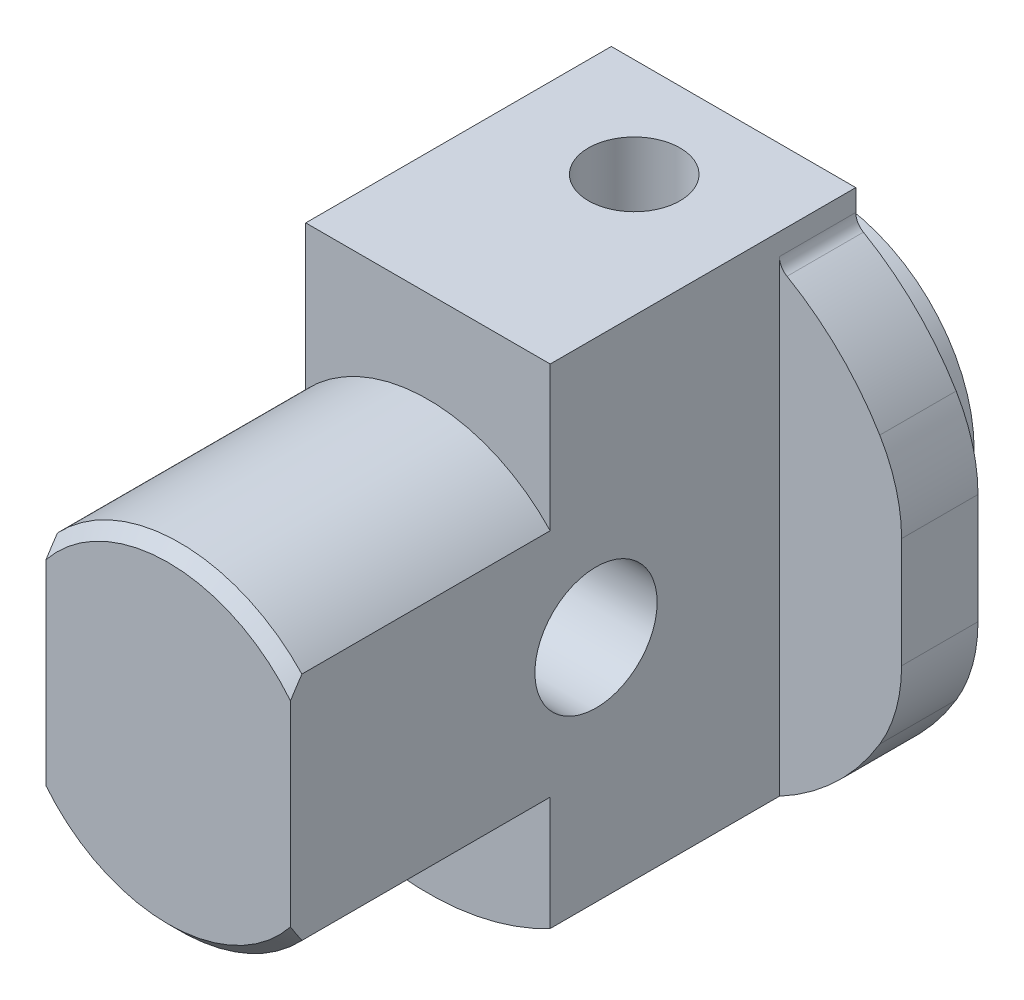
ISO-10303-21;
HEADER;
FILE_DESCRIPTION(('STEP AP214'),'2;1');
FILE_NAME('part.step','',(''),(''),'','','');
FILE_SCHEMA(('AUTOMOTIVE_DESIGN { 1 0 10303 214 1 1 1 1 }'));
ENDSEC;
DATA;
#1=APPLICATION_CONTEXT('core data for automotive mechanical design processes');
#2=APPLICATION_PROTOCOL_DEFINITION('international standard','automotive_design',2000,#1);
#3=PRODUCT_CONTEXT('',#1,'mechanical');
#4=PRODUCT('Part','Part','',(#3));
#5=PRODUCT_RELATED_PRODUCT_CATEGORY('part','',(#4));
#6=PRODUCT_DEFINITION_FORMATION('','',#4);
#7=PRODUCT_DEFINITION_CONTEXT('part definition',#1,'design');
#8=PRODUCT_DEFINITION('design','',#6,#7);
#9=PRODUCT_DEFINITION_SHAPE('','',#8);
#10=(LENGTH_UNIT() NAMED_UNIT(*) SI_UNIT(.MILLI.,.METRE.));
#11=(NAMED_UNIT(*) PLANE_ANGLE_UNIT() SI_UNIT($,.RADIAN.));
#12=(NAMED_UNIT(*) SI_UNIT($,.STERADIAN.) SOLID_ANGLE_UNIT());
#13=UNCERTAINTY_MEASURE_WITH_UNIT(LENGTH_MEASURE(1.E-05),#10,'distance_accuracy_value','');
#14=(GEOMETRIC_REPRESENTATION_CONTEXT(3) GLOBAL_UNCERTAINTY_ASSIGNED_CONTEXT((#13)) GLOBAL_UNIT_ASSIGNED_CONTEXT((#10,
#11,#12)) REPRESENTATION_CONTEXT('',''));
#15=CARTESIAN_POINT('',(0.,0.,0.));
#16=DIRECTION('',(0.,0.,1.));
#17=DIRECTION('',(1.,0.,0.));
#18=AXIS2_PLACEMENT_3D('',#15,#16,#17);
#19=CARTESIAN_POINT('',(0.,0.,20.));
#20=DIRECTION('',(0.,0.,-1.));
#21=DIRECTION('',(-1.,0.,0.));
#22=AXIS2_PLACEMENT_3D('',#19,#20,#21);
#23=CYLINDRICAL_SURFACE('',#22,17.);
#24=CARTESIAN_POINT('',(0.,0.,5.));
#25=DIRECTION('',(0.,0.,-1.));
#26=DIRECTION('',(-1.,0.,0.));
#27=AXIS2_PLACEMENT_3D('',#24,#25,#26);
#28=CIRCLE('',#27,17.);
#29=CARTESIAN_POINT('',(-8.,-15.,5.));
#30=VERTEX_POINT('',#29);
#31=CARTESIAN_POINT('',(-14.5714285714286,-8.75633881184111,5.));
#32=VERTEX_POINT('',#31);
#33=EDGE_CURVE('E178',#30,#32,#28,.T.);
#34=ORIENTED_EDGE('',*,*,#33,.T.);
#35=DIRECTION('',(0.,0.,-1.));
#36=VECTOR('',#35,1.);
#37=CARTESIAN_POINT('',(-14.5714285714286,-8.75633881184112,20.));
#38=LINE('',#37,#36);
#39=CARTESIAN_POINT('',(-14.5714285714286,-8.75633881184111,0.));
#40=VERTEX_POINT('',#39);
#41=EDGE_CURVE('E316',#32,#40,#38,.T.);
#42=ORIENTED_EDGE('',*,*,#41,.T.);
#43=CARTESIAN_POINT('',(0.,0.,0.));
#44=DIRECTION('',(0.,0.,1.));
#45=DIRECTION('',(1.,0.,0.));
#46=AXIS2_PLACEMENT_3D('',#43,#44,#45);
#47=CIRCLE('',#46,17.);
#48=CARTESIAN_POINT('',(14.5714285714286,-8.7563388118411,0.));
#49=VERTEX_POINT('',#48);
#50=EDGE_CURVE('E360',#40,#49,#47,.T.);
#51=ORIENTED_EDGE('',*,*,#50,.T.);
#52=DIRECTION('',(0.,0.,-1.));
#53=VECTOR('',#52,1.);
#54=CARTESIAN_POINT('',(14.5714285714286,-8.7563388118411,20.));
#55=LINE('',#54,#53);
#56=CARTESIAN_POINT('',(14.5714285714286,-8.7563388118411,5.));
#57=VERTEX_POINT('',#56);
#58=EDGE_CURVE('E313',#49,#57,#55,.F.);
#59=ORIENTED_EDGE('',*,*,#58,.T.);
#60=CARTESIAN_POINT('',(0.,0.,5.));
#61=DIRECTION('',(0.,0.,1.));
#62=DIRECTION('',(1.,0.,0.));
#63=AXIS2_PLACEMENT_3D('',#60,#61,#62);
#64=CIRCLE('',#63,17.);
#65=CARTESIAN_POINT('',(8.,-15.,5.));
#66=VERTEX_POINT('',#65);
#67=EDGE_CURVE('E271',#66,#57,#64,.T.);
#68=ORIENTED_EDGE('',*,*,#67,.F.);
#69=DIRECTION('',(0.,0.,-1.));
#70=VECTOR('',#69,1.);
#71=CARTESIAN_POINT('',(8.,-15.,20.));
#72=LINE('',#71,#70);
#73=CARTESIAN_POINT('',(8.,-15.,20.));
#74=VERTEX_POINT('',#73);
#75=EDGE_CURVE('E228',#66,#74,#72,.F.);
#76=ORIENTED_EDGE('',*,*,#75,.T.);
#77=CARTESIAN_POINT('',(0.,0.,20.));
#78=DIRECTION('',(0.,0.,1.));
#79=DIRECTION('',(1.,0.,0.));
#80=AXIS2_PLACEMENT_3D('',#77,#78,#79);
#81=CIRCLE('',#80,17.);
#82=CARTESIAN_POINT('',(-8.00000000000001,-15.,20.));
#83=VERTEX_POINT('',#82);
#84=EDGE_CURVE('E206',#83,#74,#81,.T.);
#85=ORIENTED_EDGE('',*,*,#84,.F.);
#86=DIRECTION('',(0.,0.,-1.));
#87=VECTOR('',#86,1.);
#88=CARTESIAN_POINT('',(-8.,-15.,20.));
#89=LINE('',#88,#87);
#90=EDGE_CURVE('E197',#30,#83,#89,.F.);
#91=ORIENTED_EDGE('',*,*,#90,.F.);
#92=EDGE_LOOP('',(#34,#42,#51,#59,#68,#76,#85,#91));
#93=FACE_BOUND('',#92,.T.);
#94=ADVANCED_FACE('F30',(#93),#23,.T.);
#95=CARTESIAN_POINT('',(14.5714285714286,8.7563388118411,5.));
#96=VERTEX_POINT('',#95);
#97=CARTESIAN_POINT('',(8.5,14.7224318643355,5.));
#98=VERTEX_POINT('',#97);
#99=EDGE_CURVE('E270',#96,#98,#64,.T.);
#100=ORIENTED_EDGE('',*,*,#99,.F.);
#101=DIRECTION('',(0.,0.,-1.));
#102=VECTOR('',#101,1.);
#103=CARTESIAN_POINT('',(14.5714285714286,8.7563388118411,20.));
#104=LINE('',#103,#102);
#105=CARTESIAN_POINT('',(14.5714285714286,8.7563388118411,0.));
#106=VERTEX_POINT('',#105);
#107=EDGE_CURVE('E11',#96,#106,#104,.T.);
#108=ORIENTED_EDGE('',*,*,#107,.T.);
#109=CARTESIAN_POINT('',(8.5,14.7224318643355,0.));
#110=VERTEX_POINT('',#109);
#111=EDGE_CURVE('E374',#106,#110,#47,.T.);
#112=ORIENTED_EDGE('',*,*,#111,.T.);
#113=DIRECTION('',(0.,0.,-1.));
#114=VECTOR('',#113,1.);
#115=CARTESIAN_POINT('',(8.5,14.7224318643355,20.));
#116=LINE('',#115,#114);
#117=EDGE_CURVE('E370',#98,#110,#116,.T.);
#118=ORIENTED_EDGE('',*,*,#117,.F.);
#119=EDGE_LOOP('',(#100,#108,#112,#118));
#120=FACE_BOUND('',#119,.T.);
#121=ADVANCED_FACE('F373',(#120),#23,.T.);
#122=CARTESIAN_POINT('',(0.,0.,37.001));
#123=DIRECTION('',(0.,0.,-1.));
#124=DIRECTION('',(-1.,0.,0.));
#125=AXIS2_PLACEMENT_3D('',#122,#123,#124);
#126=CYLINDRICAL_SURFACE('',#125,2.5);
#127=CARTESIAN_POINT('',(-2.5,0.,4.84168760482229));
#128=CARTESIAN_POINT('',(-2.49999381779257,-0.0883044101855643,4.84167151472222));
#129=CARTESIAN_POINT('',(-2.49526266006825,-0.176759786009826,4.8344789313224));
#130=CARTESIAN_POINT('',(-2.47682990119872,-0.350777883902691,4.80720372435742));
#131=CARTESIAN_POINT('',(-2.46309747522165,-0.436329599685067,4.78707681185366));
#132=CARTESIAN_POINT('',(-2.42086856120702,-0.635105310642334,4.72766884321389));
#133=CARTESIAN_POINT('',(-2.38871146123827,-0.746191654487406,4.68398640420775));
#134=CARTESIAN_POINT('',(-2.31147102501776,-0.959177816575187,4.58663232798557));
#135=CARTESIAN_POINT('',(-2.26634586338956,-1.061046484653,4.53292856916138));
#136=CARTESIAN_POINT('',(-2.1784743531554,-1.22904561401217,4.4366871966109));
#137=CARTESIAN_POINT('',(-2.1385289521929,-1.29726159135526,4.39517511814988));
#138=CARTESIAN_POINT('',(-2.05264418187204,-1.42928710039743,4.31133355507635));
#139=CARTESIAN_POINT('',(-2.00670223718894,-1.49309472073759,4.26900372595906));
#140=CARTESIAN_POINT('',(-1.86006177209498,-1.6777567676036,4.14272611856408));
#141=CARTESIAN_POINT('',(-1.75039822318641,-1.79213663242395,4.05931568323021));
#142=CARTESIAN_POINT('',(-1.53331236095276,-1.97859400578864,3.91891635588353));
#143=CARTESIAN_POINT('',(-1.43034863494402,-2.05449822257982,3.86007590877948));
#144=CARTESIAN_POINT('',(-1.2102730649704,-2.19133705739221,3.75224209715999));
#145=CARTESIAN_POINT('',(-1.0931846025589,-2.25229592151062,3.70323280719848));
#146=CARTESIAN_POINT('',(-0.867930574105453,-2.34711286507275,3.62627076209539));
#147=CARTESIAN_POINT('',(-0.761720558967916,-2.38383396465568,3.59614269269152));
#148=CARTESIAN_POINT('',(-0.542834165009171,-2.44298040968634,3.5473961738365));
#149=CARTESIAN_POINT('',(-0.430161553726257,-2.46541399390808,3.52877109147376));
#150=CARTESIAN_POINT('',(-0.200906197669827,-2.49460149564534,3.50450839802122));
#151=CARTESIAN_POINT('',(-0.0843091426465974,-2.50128982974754,3.49892511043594));
#152=CARTESIAN_POINT('',(0.148527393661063,-2.4982977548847,3.50141856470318));
#153=CARTESIAN_POINT('',(0.264766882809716,-2.48861770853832,3.50949500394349));
#154=CARTESIAN_POINT('',(0.485446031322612,-2.45478575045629,3.53758664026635));
#155=CARTESIAN_POINT('',(0.590154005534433,-2.43164888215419,3.5567640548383));
#156=CARTESIAN_POINT('',(0.793626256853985,-2.37305216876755,3.60498687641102));
#157=CARTESIAN_POINT('',(0.892389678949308,-2.33759055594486,3.63403369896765));
#158=CARTESIAN_POINT('',(1.09053364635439,-2.25240882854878,3.70309694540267));
#159=CARTESIAN_POINT('',(1.18924374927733,-2.20172823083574,3.7438393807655));
#160=CARTESIAN_POINT('',(1.37677917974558,-2.08960330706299,3.83255237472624));
#161=CARTESIAN_POINT('',(1.46559550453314,-2.02814930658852,3.88052942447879));
#162=CARTESIAN_POINT('',(1.67280381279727,-1.86454067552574,4.0055121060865));
#163=CARTESIAN_POINT('',(1.78517417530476,-1.75692877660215,4.08547216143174));
#164=CARTESIAN_POINT('',(1.93670187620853,-1.58275969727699,4.20796054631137));
#165=CARTESIAN_POINT('',(1.98442734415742,-1.522485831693,4.24927368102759));
#166=CARTESIAN_POINT('',(2.07418694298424,-1.39772821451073,4.33171624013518));
#167=CARTESIAN_POINT('',(2.11622312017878,-1.33324598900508,4.37284572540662));
#168=CARTESIAN_POINT('',(2.21282833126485,-1.16888139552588,4.47263986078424));
#169=CARTESIAN_POINT('',(2.26407571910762,-1.06653640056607,4.53051818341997));
#170=CARTESIAN_POINT('',(2.35314050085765,-0.852138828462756,4.6378614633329));
#171=CARTESIAN_POINT('',(2.39099600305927,-0.740114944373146,4.68735008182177));
#172=CARTESIAN_POINT('',(2.4414108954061,-0.544179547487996,4.75623392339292));
#173=CARTESIAN_POINT('',(2.45819358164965,-0.46300124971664,4.78018050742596));
#174=CARTESIAN_POINT('',(2.48370273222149,-0.297038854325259,4.81722331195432));
#175=CARTESIAN_POINT('',(2.49244814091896,-0.21226373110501,4.83034503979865));
#176=CARTESIAN_POINT('',(2.50115517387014,-0.0405722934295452,4.84340689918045));
#177=CARTESIAN_POINT('',(2.5010533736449,0.0463550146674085,4.84325185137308));
#178=CARTESIAN_POINT('',(2.49191597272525,0.218705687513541,4.82954856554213));
#179=CARTESIAN_POINT('',(2.48286800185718,0.304126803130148,4.81598178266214));
#180=CARTESIAN_POINT('',(2.45336046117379,0.492184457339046,4.77320113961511));
#181=CARTESIAN_POINT('',(2.43059717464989,0.593724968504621,4.74090244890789));
#182=CARTESIAN_POINT('',(2.3742256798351,0.789632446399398,4.66553702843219));
#183=CARTESIAN_POINT('',(2.34058163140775,0.883974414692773,4.62243482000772));
#184=CARTESIAN_POINT('',(2.27197464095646,1.04599478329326,4.54031590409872));
#185=CARTESIAN_POINT('',(2.23884949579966,1.11504573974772,4.50241233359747));
#186=CARTESIAN_POINT('',(2.16695951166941,1.24902849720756,4.42464683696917));
#187=CARTESIAN_POINT('',(2.12819176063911,1.31395814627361,4.38478390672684));
#188=CARTESIAN_POINT('',(2.04513177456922,1.43983390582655,4.30437271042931));
#189=CARTESIAN_POINT('',(2.00083502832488,1.50077670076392,4.26382390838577));
#190=CARTESIAN_POINT('',(1.90679633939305,1.61858494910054,4.18310931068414));
#191=CARTESIAN_POINT('',(1.85705157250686,1.67544826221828,4.14294372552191));
#192=CARTESIAN_POINT('',(1.69691470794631,1.842454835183,4.0223887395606));
#193=CARTESIAN_POINT('',(1.57762869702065,1.94593753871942,3.94398864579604));
#194=CARTESIAN_POINT('',(1.38213833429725,2.08472063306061,3.83631005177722));
#195=CARTESIAN_POINT('',(1.31428144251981,2.12821052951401,3.80209646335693));
#196=CARTESIAN_POINT('',(1.17320567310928,2.20911674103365,3.73782955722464));
#197=CARTESIAN_POINT('',(1.09999000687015,2.24653665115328,3.70777377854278));
#198=CARTESIAN_POINT('',(0.923231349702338,2.32591734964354,3.64357234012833));
#199=CARTESIAN_POINT('',(0.817729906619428,2.36521682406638,3.61141633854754));
#200=CARTESIAN_POINT('',(0.59979753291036,2.42963624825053,3.55843649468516));
#201=CARTESIAN_POINT('',(0.48737207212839,2.45476723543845,3.53760383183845));
#202=CARTESIAN_POINT('',(0.257904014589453,2.48937715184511,3.50886245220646));
#203=CARTESIAN_POINT('',(0.140841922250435,2.49878071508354,3.50101596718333));
#204=CARTESIAN_POINT('',(-0.0935504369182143,2.50099563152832,3.49917040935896));
#205=CARTESIAN_POINT('',(-0.210880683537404,2.49380819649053,3.50517032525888));
#206=CARTESIAN_POINT('',(-0.43347899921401,2.46450495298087,3.52952427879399));
#207=CARTESIAN_POINT('',(-0.539003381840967,2.44351396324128,3.54694718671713));
#208=CARTESIAN_POINT('',(-0.744442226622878,2.38895614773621,3.5919294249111));
#209=CARTESIAN_POINT('',(-0.844355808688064,2.35538735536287,3.61949034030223));
#210=CARTESIAN_POINT('',(-1.04384055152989,2.27438284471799,3.68535656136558));
#211=CARTESIAN_POINT('',(-1.1428617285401,2.2261182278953,3.72429596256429));
#212=CARTESIAN_POINT('',(-1.33135097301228,2.11879506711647,3.80960199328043));
#213=CARTESIAN_POINT('',(-1.42081159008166,2.05972820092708,3.85597434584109));
#214=CARTESIAN_POINT('',(-1.63002558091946,1.90195625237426,3.97735148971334));
#215=CARTESIAN_POINT('',(-1.74390511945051,1.79777364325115,4.05547179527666));
#216=CARTESIAN_POINT('',(-1.89807730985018,1.62884627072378,4.1758666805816));
#217=CARTESIAN_POINT('',(-1.94675534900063,1.57032869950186,4.21659901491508));
#218=CARTESIAN_POINT('',(-2.03855478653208,1.44915853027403,4.29816931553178));
#219=CARTESIAN_POINT('',(-2.08167789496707,1.38650721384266,4.33900724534));
#220=CARTESIAN_POINT('',(-2.18509588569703,1.22050831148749,4.44250264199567));
#221=CARTESIAN_POINT('',(-2.24133685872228,1.11415765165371,4.50445937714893));
#222=CARTESIAN_POINT('',(-2.33909634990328,0.890744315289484,4.62002364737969));
#223=CARTESIAN_POINT('',(-2.38065496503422,0.773711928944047,4.67365369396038));
#224=CARTESIAN_POINT('',(-2.43556494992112,0.570125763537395,4.74802892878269));
#225=CARTESIAN_POINT('',(-2.4537026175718,0.486726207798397,4.77375620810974));
#226=CARTESIAN_POINT('',(-2.48144437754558,0.315972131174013,4.81386573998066));
#227=CARTESIAN_POINT('',(-2.49108129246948,0.2286342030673,4.82829160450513));
#228=CARTESIAN_POINT('',(-2.49736160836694,0.117208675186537,4.83771641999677));
#229=CARTESIAN_POINT('',(-2.49834926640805,0.0938071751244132,4.83920113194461));
#230=CARTESIAN_POINT('',(-2.49966934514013,0.0469406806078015,4.84118895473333));
#231=CARTESIAN_POINT('',(-2.50000164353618,0.0234756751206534,4.84169188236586));
#232=CARTESIAN_POINT('',(-2.5,0.,4.84168760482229));
#233=B_SPLINE_CURVE_WITH_KNOTS('',3,(#127,#128,#129,#130,#131,#132,#133,#134,#135,#136,#137,
#138,#139,#140,#141,#142,#143,#144,#145,#146,#147,#148,#149,#150,#151,#152,#153,#154,#155,#156,
#157,#158,#159,#160,#161,#162,#163,#164,#165,#166,#167,#168,#169,#170,#171,#172,#173,#174,#175,
#176,#177,#178,#179,#180,#181,#182,#183,#184,#185,#186,#187,#188,#189,#190,#191,#192,#193,#194,
#195,#196,#197,#198,#199,#200,#201,#202,#203,#204,#205,#206,#207,#208,#209,#210,#211,#212,#213,
#214,#215,#216,#217,#218,#219,#220,#221,#222,#223,#224,#225,#226,#227,#228,#229,#230,#231,#232),
.UNSPECIFIED.,.T.,.F.,(4,2,2,2,2,2,2,2,2,2,2,2,2,2,2,2,2,2,2,2,2,2,2,2,2,2,2,2,2,2,2,2,2,2,2,2,
2,2,2,2,2,2,2,2,2,2,2,2,2,2,2,2,4),(0.,0.26480748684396,0.530526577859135,0.899311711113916,
1.26929988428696,1.53684271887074,1.80450083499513,2.33872733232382,2.75963734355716,
3.17985991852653,3.52745225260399,3.87484396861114,4.22368012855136,4.57250856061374,
4.89792180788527,5.22338174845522,5.57669292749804,5.93032301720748,6.45212646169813,
6.71375344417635,6.97528607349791,7.35902155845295,7.74165612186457,7.99961659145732,
8.25696746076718,8.51616339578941,8.77571823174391,9.10077852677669,9.42692063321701,
9.6829620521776,9.9391360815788,10.1955205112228,10.4520384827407,10.9775613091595,
11.2398627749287,11.502008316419,11.8517559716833,12.201230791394,12.5523755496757,
12.903494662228,13.2290536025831,13.5546634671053,13.903879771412,14.2533662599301,
14.7693582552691,15.0281495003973,15.2868608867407,15.691662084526,16.0953490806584,
16.3618811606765,16.6273795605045,16.697765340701,16.7681642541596),.UNSPECIFIED.);
#234=CARTESIAN_POINT('',(-2.5,0.,4.84168760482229));
#235=VERTEX_POINT('',#234);
#236=EDGE_CURVE('E234',#235,#235,#233,.T.);
#237=ORIENTED_EDGE('',*,*,#236,.T.);
#238=EDGE_LOOP('',(#237));
#239=FACE_BOUND('',#238,.T.);
#240=CARTESIAN_POINT('',(0.,0.,-0.5));
#241=DIRECTION('',(0.,0.,-1.));
#242=DIRECTION('',(-1.,0.,0.));
#243=AXIS2_PLACEMENT_3D('',#240,#241,#242);
#244=CIRCLE('',#243,2.5);
#245=CARTESIAN_POINT('',(-2.5,0.,-0.5));
#246=VERTEX_POINT('',#245);
#247=EDGE_CURVE('E299',#246,#246,#244,.F.);
#248=ORIENTED_EDGE('',*,*,#247,.F.);
#249=EDGE_LOOP('',(#248));
#250=FACE_BOUND('',#249,.T.);
#251=ADVANCED_FACE('F243',(#239,#250),#126,.F.);
#252=CARTESIAN_POINT('',(9.,15.5884572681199,20.));
#253=DIRECTION('',(0.,0.,-1.));
#254=DIRECTION('',(-1.,0.,0.));
#255=AXIS2_PLACEMENT_3D('',#252,#253,#254);
#256=PLANE('',#255);
#257=DIRECTION('',(0.,1.,0.));
#258=VECTOR('',#257,1.);
#259=CARTESIAN_POINT('',(-8.,15.5884572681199,20.));
#260=LINE('',#259,#258);
#261=CARTESIAN_POINT('',(-8.,-7.54983443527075,20.));
#262=VERTEX_POINT('',#261);
#263=EDGE_CURVE('E208',#83,#262,#260,.T.);
#264=ORIENTED_EDGE('',*,*,#263,.F.);
#265=ORIENTED_EDGE('',*,*,#84,.T.);
#266=DIRECTION('',(0.,1.,0.));
#267=VECTOR('',#266,1.);
#268=CARTESIAN_POINT('',(8.,15.5884572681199,20.));
#269=LINE('',#268,#267);
#270=CARTESIAN_POINT('',(8.,-7.54983443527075,20.));
#271=VERTEX_POINT('',#270);
#272=EDGE_CURVE('E225',#74,#271,#269,.T.);
#273=ORIENTED_EDGE('',*,*,#272,.T.);
#274=CARTESIAN_POINT('',(0.,0.,20.));
#275=DIRECTION('',(0.,0.,-1.));
#276=DIRECTION('',(-1.,0.,0.));
#277=AXIS2_PLACEMENT_3D('',#274,#275,#276);
#278=CIRCLE('',#277,11.);
#279=EDGE_CURVE('E388',#262,#271,#278,.F.);
#280=ORIENTED_EDGE('',*,*,#279,.F.);
#281=EDGE_LOOP('',(#264,#265,#273,#280));
#282=FACE_BOUND('',#281,.T.);
#283=ADVANCED_FACE('F524',(#282),#256,.F.);
#284=DIRECTION('',(0.,-1.,0.));
#285=VECTOR('',#284,1.);
#286=CARTESIAN_POINT('',(-8.,17.,20.));
#287=LINE('',#286,#285);
#288=CARTESIAN_POINT('',(-8.,17.,20.));
#289=VERTEX_POINT('',#288);
#290=CARTESIAN_POINT('',(-8.,7.54983443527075,20.));
#291=VERTEX_POINT('',#290);
#292=EDGE_CURVE('E378',#289,#291,#287,.T.);
#293=ORIENTED_EDGE('',*,*,#292,.T.);
#294=CARTESIAN_POINT('',(8.,7.54983443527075,20.));
#295=VERTEX_POINT('',#294);
#296=EDGE_CURVE('E389',#295,#291,#278,.F.);
#297=ORIENTED_EDGE('',*,*,#296,.F.);
#298=DIRECTION('',(0.,-1.,0.));
#299=VECTOR('',#298,1.);
#300=CARTESIAN_POINT('',(8.,17.,20.));
#301=LINE('',#300,#299);
#302=CARTESIAN_POINT('',(8.,17.,20.));
#303=VERTEX_POINT('',#302);
#304=EDGE_CURVE('E452',#303,#295,#301,.T.);
#305=ORIENTED_EDGE('',*,*,#304,.F.);
#306=DIRECTION('',(1.,0.,0.));
#307=VECTOR('',#306,1.);
#308=CARTESIAN_POINT('',(-8.,17.,20.));
#309=LINE('',#308,#307);
#310=EDGE_CURVE('E458',#289,#303,#309,.T.);
#311=ORIENTED_EDGE('',*,*,#310,.F.);
#312=EDGE_LOOP('',(#293,#297,#305,#311));
#313=FACE_BOUND('',#312,.T.);
#314=ADVANCED_FACE('F462',(#313),#256,.F.);
#315=CARTESIAN_POINT('',(-8.5,14.7224318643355,0.));
#316=VERTEX_POINT('',#315);
#317=CARTESIAN_POINT('',(-14.5714285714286,8.75633881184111,0.));
#318=VERTEX_POINT('',#317);
#319=EDGE_CURVE('E449',#316,#318,#47,.T.);
#320=ORIENTED_EDGE('',*,*,#319,.T.);
#321=DIRECTION('',(0.,0.,-1.));
#322=VECTOR('',#321,1.);
#323=CARTESIAN_POINT('',(-14.5714285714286,8.75633881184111,20.));
#324=LINE('',#323,#322);
#325=CARTESIAN_POINT('',(-14.5714285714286,8.75633881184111,5.));
#326=VERTEX_POINT('',#325);
#327=EDGE_CURVE('E333',#318,#326,#324,.F.);
#328=ORIENTED_EDGE('',*,*,#327,.T.);
#329=CARTESIAN_POINT('',(-8.5,14.7224318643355,5.));
#330=VERTEX_POINT('',#329);
#331=EDGE_CURVE('E192',#326,#330,#28,.T.);
#332=ORIENTED_EDGE('',*,*,#331,.T.);
#333=DIRECTION('',(0.,0.,-1.));
#334=VECTOR('',#333,1.);
#335=CARTESIAN_POINT('',(-8.5,14.7224318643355,20.));
#336=LINE('',#335,#334);
#337=EDGE_CURVE('E375',#330,#316,#336,.T.);
#338=ORIENTED_EDGE('',*,*,#337,.T.);
#339=EDGE_LOOP('',(#320,#328,#332,#338));
#340=FACE_BOUND('',#339,.T.);
#341=ADVANCED_FACE('F511',(#340),#23,.T.);
#342=CARTESIAN_POINT('',(0.,0.,37.));
#343=DIRECTION('',(0.,0.,-1.));
#344=DIRECTION('',(-1.,0.,0.));
#345=AXIS2_PLACEMENT_3D('',#342,#343,#344);
#346=CYLINDRICAL_SURFACE('',#345,11.);
#347=DIRECTION('',(0.,0.,-1.));
#348=VECTOR('',#347,1.);
#349=CARTESIAN_POINT('',(-8.,7.54983443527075,37.));
#350=LINE('',#349,#348);
#351=CARTESIAN_POINT('',(-8.,7.54983443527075,36.25));
#352=VERTEX_POINT('',#351);
#353=EDGE_CURVE('E421',#352,#291,#350,.T.);
#354=ORIENTED_EDGE('',*,*,#353,.F.);
#355=CARTESIAN_POINT('',(0.,0.,36.25));
#356=DIRECTION('',(0.,0.,1.));
#357=DIRECTION('',(1.,0.,0.));
#358=AXIS2_PLACEMENT_3D('',#355,#356,#357);
#359=CIRCLE('',#358,11.);
#360=CARTESIAN_POINT('',(8.,7.54983443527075,36.25));
#361=VERTEX_POINT('',#360);
#362=EDGE_CURVE('E396',#352,#361,#359,.F.);
#363=ORIENTED_EDGE('',*,*,#362,.T.);
#364=DIRECTION('',(0.,0.,-1.));
#365=VECTOR('',#364,1.);
#366=CARTESIAN_POINT('',(8.,7.54983443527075,37.));
#367=LINE('',#366,#365);
#368=EDGE_CURVE('E221',#361,#295,#367,.T.);
#369=ORIENTED_EDGE('',*,*,#368,.T.);
#370=ORIENTED_EDGE('',*,*,#296,.T.);
#371=EDGE_LOOP('',(#354,#363,#369,#370));
#372=FACE_BOUND('',#371,.T.);
#373=ADVANCED_FACE('F423',(#372),#346,.T.);
#374=DIRECTION('',(0.,0.,-1.));
#375=VECTOR('',#374,1.);
#376=CARTESIAN_POINT('',(-8.,-7.54983443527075,37.));
#377=LINE('',#376,#375);
#378=CARTESIAN_POINT('',(-8.,-7.54983443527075,36.25));
#379=VERTEX_POINT('',#378);
#380=EDGE_CURVE('E212',#262,#379,#377,.F.);
#381=ORIENTED_EDGE('',*,*,#380,.F.);
#382=ORIENTED_EDGE('',*,*,#279,.T.);
#383=DIRECTION('',(0.,0.,-1.));
#384=VECTOR('',#383,1.);
#385=CARTESIAN_POINT('',(8.,-7.54983443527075,37.));
#386=LINE('',#385,#384);
#387=CARTESIAN_POINT('',(8.,-7.54983443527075,36.25));
#388=VERTEX_POINT('',#387);
#389=EDGE_CURVE('E224',#271,#388,#386,.F.);
#390=ORIENTED_EDGE('',*,*,#389,.T.);
#391=EDGE_CURVE('E397',#388,#379,#359,.F.);
#392=ORIENTED_EDGE('',*,*,#391,.T.);
#393=EDGE_LOOP('',(#381,#382,#390,#392));
#394=FACE_BOUND('',#393,.T.);
#395=ADVANCED_FACE('F523',(#394),#346,.T.);
#396=CARTESIAN_POINT('',(0.,0.,37.));
#397=DIRECTION('',(0.,0.,1.));
#398=DIRECTION('',(1.,0.,0.));
#399=AXIS2_PLACEMENT_3D('',#396,#397,#398);
#400=PLANE('',#399);
#401=CARTESIAN_POINT('',(0.,0.,37.));
#402=DIRECTION('',(0.,0.,1.));
#403=DIRECTION('',(1.,0.,0.));
#404=AXIS2_PLACEMENT_3D('',#401,#402,#403);
#405=CIRCLE('',#404,10.25);
#406=CARTESIAN_POINT('',(8.,6.40800280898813,37.));
#407=VERTEX_POINT('',#406);
#408=CARTESIAN_POINT('',(-8.,6.40800280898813,37.));
#409=VERTEX_POINT('',#408);
#410=EDGE_CURVE('E393',#407,#409,#405,.T.);
#411=ORIENTED_EDGE('',*,*,#410,.T.);
#412=DIRECTION('',(0.,-1.,0.));
#413=VECTOR('',#412,1.);
#414=CARTESIAN_POINT('',(-8.,0.,37.));
#415=LINE('',#414,#413);
#416=CARTESIAN_POINT('',(-8.,-6.40800280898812,37.));
#417=VERTEX_POINT('',#416);
#418=EDGE_CURVE('E201',#409,#417,#415,.T.);
#419=ORIENTED_EDGE('',*,*,#418,.T.);
#420=CARTESIAN_POINT('',(8.,-6.40800280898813,37.));
#421=VERTEX_POINT('',#420);
#422=EDGE_CURVE('E392',#417,#421,#405,.T.);
#423=ORIENTED_EDGE('',*,*,#422,.T.);
#424=DIRECTION('',(0.,-1.,0.));
#425=VECTOR('',#424,1.);
#426=CARTESIAN_POINT('',(8.,0.,37.));
#427=LINE('',#426,#425);
#428=EDGE_CURVE('E218',#407,#421,#427,.T.);
#429=ORIENTED_EDGE('',*,*,#428,.F.);
#430=EDGE_LOOP('',(#411,#419,#423,#429));
#431=FACE_BOUND('',#430,.T.);
#432=ADVANCED_FACE('F279',(#431),#400,.T.);
#433=CARTESIAN_POINT('',(0.,0.,37.));
#434=DIRECTION('',(0.,0.,-1.));
#435=DIRECTION('',(-1.,0.,0.));
#436=AXIS2_PLACEMENT_3D('',#433,#434,#435);
#437=CONICAL_SURFACE('',#436,10.25,0.785398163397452);
#438=ORIENTED_EDGE('',*,*,#422,.F.);
#439=CARTESIAN_POINT('',(-8.,-1.91157460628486,39.0247876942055));
#440=CARTESIAN_POINT('',(-8.,-2.23510741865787,38.9495825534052));
#441=CARTESIAN_POINT('',(-8.,-2.55409083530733,38.8573869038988));
#442=CARTESIAN_POINT('',(-8.,-3.18190098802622,38.6455073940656));
#443=CARTESIAN_POINT('',(-8.,-3.49075340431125,38.5259003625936));
#444=CARTESIAN_POINT('',(-8.,-4.0962599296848,38.266396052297));
#445=CARTESIAN_POINT('',(-8.,-4.39299968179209,38.1266940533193));
#446=CARTESIAN_POINT('',(-8.,-4.97837042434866,37.8308525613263));
#447=CARTESIAN_POINT('',(-8.,-5.26699557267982,37.6747015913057));
#448=CARTESIAN_POINT('',(-8.,-5.74806617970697,37.4004124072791));
#449=CARTESIAN_POINT('',(-8.,-5.94243474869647,37.2856068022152));
#450=CARTESIAN_POINT('',(-8.,-6.32802596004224,37.0509558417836));
#451=CARTESIAN_POINT('',(-8.,-6.5192495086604,36.9311119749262));
#452=CARTESIAN_POINT('',(-8.,-6.89975266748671,36.6866079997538));
#453=CARTESIAN_POINT('',(-8.,-7.08902029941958,36.5619293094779));
#454=CARTESIAN_POINT('',(-8.,-7.46507942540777,36.3088816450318));
#455=CARTESIAN_POINT('',(-8.,-7.65187080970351,36.1805125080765));
#456=CARTESIAN_POINT('',(-8.,-8.0652289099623,35.8912393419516));
#457=CARTESIAN_POINT('',(-8.,-8.29123971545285,35.7295416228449));
#458=CARTESIAN_POINT('',(-8.,-8.74037999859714,35.4021877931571));
#459=CARTESIAN_POINT('',(-8.,-8.96350937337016,35.2365315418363));
#460=CARTESIAN_POINT('',(-8.,-9.62921541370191,34.7345500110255));
#461=CARTESIAN_POINT('',(-8.,-10.0680469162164,34.3932566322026));
#462=CARTESIAN_POINT('',(-8.,-10.9384408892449,33.7008248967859));
#463=CARTESIAN_POINT('',(-8.,-11.3699967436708,33.3496782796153));
#464=CARTESIAN_POINT('',(-8.,-12.2271789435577,32.6402059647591));
#465=CARTESIAN_POINT('',(-8.,-12.6528050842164,32.2818800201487));
#466=CARTESIAN_POINT('',(-8.,-13.4889286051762,31.5686467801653));
#467=CARTESIAN_POINT('',(-8.,-13.8995402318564,31.2138730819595));
#468=CARTESIAN_POINT('',(-8.,-14.7171814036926,30.5002037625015));
#469=CARTESIAN_POINT('',(-8.,-15.1242108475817,30.1413080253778));
#470=CARTESIAN_POINT('',(-8.,-15.9344337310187,29.4210417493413));
#471=CARTESIAN_POINT('',(-8.,-16.3376337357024,29.0596785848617));
#472=CARTESIAN_POINT('',(-8.,-17.1415829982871,28.3342848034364));
#473=CARTESIAN_POINT('',(-8.,-17.542332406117,27.9702543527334));
#474=CARTESIAN_POINT('',(-8.,-17.9421117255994,27.6051693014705));
#475=B_SPLINE_CURVE_WITH_KNOTS('',3,(#439,#440,#441,#442,#443,#444,#445,#446,#447,#448,#449,
#450,#451,#452,#453,#454,#455,#456,#457,#458,#459,#460,#461,#462,#463,#464,#465,#466,#467,#468,
#469,#470,#471,#472,#473,#474),.UNSPECIFIED.,.F.,.F.,(4,2,2,2,2,2,2,2,2,2,2,2,2,2,2,2,2,4),(0.,
0.995173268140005,1.98759064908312,2.97094461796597,3.95498930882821,4.63214078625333,
5.30909359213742,5.9889730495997,6.66888254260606,7.50252126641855,8.33618967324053,
10.0037582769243,11.6727693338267,13.3418378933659,14.9697475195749,16.5977030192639,
18.2219999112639,19.846196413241),.UNSPECIFIED.);
#476=EDGE_CURVE('E293',#417,#379,#475,.T.);
#477=ORIENTED_EDGE('',*,*,#476,.T.);
#478=ORIENTED_EDGE('',*,*,#391,.F.);
#479=CARTESIAN_POINT('',(8.,-1.91157460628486,39.0247876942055));
#480=CARTESIAN_POINT('',(8.,-2.23510741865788,38.9495825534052));
#481=CARTESIAN_POINT('',(8.,-2.55409083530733,38.8573869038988));
#482=CARTESIAN_POINT('',(8.,-3.18190098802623,38.6455073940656));
#483=CARTESIAN_POINT('',(8.,-3.49075340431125,38.5259003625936));
#484=CARTESIAN_POINT('',(8.,-4.0962599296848,38.266396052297));
#485=CARTESIAN_POINT('',(8.,-4.3929996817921,38.1266940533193));
#486=CARTESIAN_POINT('',(8.,-4.97837042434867,37.8308525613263));
#487=CARTESIAN_POINT('',(8.,-5.26699557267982,37.6747015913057));
#488=CARTESIAN_POINT('',(8.,-5.74806617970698,37.4004124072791));
#489=CARTESIAN_POINT('',(8.,-5.94243474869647,37.2856068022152));
#490=CARTESIAN_POINT('',(8.,-6.32802596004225,37.0509558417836));
#491=CARTESIAN_POINT('',(8.,-6.5192495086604,36.9311119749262));
#492=CARTESIAN_POINT('',(8.,-6.89975266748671,36.6866079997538));
#493=CARTESIAN_POINT('',(8.,-7.08902029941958,36.5619293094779));
#494=CARTESIAN_POINT('',(8.,-7.46507942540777,36.3088816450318));
#495=CARTESIAN_POINT('',(8.,-7.6518708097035,36.1805125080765));
#496=CARTESIAN_POINT('',(8.,-8.0652289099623,35.8912393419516));
#497=CARTESIAN_POINT('',(8.,-8.29123971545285,35.7295416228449));
#498=CARTESIAN_POINT('',(8.,-8.74037999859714,35.4021877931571));
#499=CARTESIAN_POINT('',(8.,-8.96350937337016,35.2365315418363));
#500=CARTESIAN_POINT('',(8.,-9.62921541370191,34.7345500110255));
#501=CARTESIAN_POINT('',(8.,-10.0680469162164,34.3932566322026));
#502=CARTESIAN_POINT('',(8.,-10.9384408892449,33.7008248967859));
#503=CARTESIAN_POINT('',(8.,-11.3699967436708,33.3496782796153));
#504=CARTESIAN_POINT('',(8.,-12.2271789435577,32.6402059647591));
#505=CARTESIAN_POINT('',(8.,-12.6528050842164,32.2818800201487));
#506=CARTESIAN_POINT('',(8.,-13.4889286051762,31.5686467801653));
#507=CARTESIAN_POINT('',(8.,-13.8995402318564,31.2138730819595));
#508=CARTESIAN_POINT('',(8.,-14.7171814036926,30.5002037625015));
#509=CARTESIAN_POINT('',(8.,-15.1242108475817,30.1413080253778));
#510=CARTESIAN_POINT('',(8.,-15.9344337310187,29.4210417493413));
#511=CARTESIAN_POINT('',(8.,-16.3376337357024,29.0596785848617));
#512=CARTESIAN_POINT('',(8.,-17.1415829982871,28.3342848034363));
#513=CARTESIAN_POINT('',(8.,-17.542332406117,27.9702543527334));
#514=CARTESIAN_POINT('',(8.,-17.9421117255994,27.6051693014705));
#515=B_SPLINE_CURVE_WITH_KNOTS('',3,(#479,#480,#481,#482,#483,#484,#485,#486,#487,#488,#489,
#490,#491,#492,#493,#494,#495,#496,#497,#498,#499,#500,#501,#502,#503,#504,#505,#506,#507,#508,
#509,#510,#511,#512,#513,#514),.UNSPECIFIED.,.F.,.F.,(4,2,2,2,2,2,2,2,2,2,2,2,2,2,2,2,2,4),(0.,
0.995173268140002,1.98759064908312,2.97094461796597,3.95498930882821,4.63214078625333,
5.30909359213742,5.98897304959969,6.66888254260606,7.50252126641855,8.33618967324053,
10.0037582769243,11.6727693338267,13.3418378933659,14.9697475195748,16.5977030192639,
18.2219999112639,19.846196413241),.UNSPECIFIED.);
#516=EDGE_CURVE('E265',#421,#388,#515,.T.);
#517=ORIENTED_EDGE('',*,*,#516,.F.);
#518=EDGE_LOOP('',(#438,#477,#478,#517));
#519=FACE_BOUND('',#518,.T.);
#520=ADVANCED_FACE('F273',(#519),#437,.T.);
#521=ORIENTED_EDGE('',*,*,#362,.F.);
#522=CARTESIAN_POINT('',(-8.,17.9421117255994,27.6051693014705));
#523=CARTESIAN_POINT('',(-8.,17.5331504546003,27.9786359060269));
#524=CARTESIAN_POINT('',(-8.,17.1231761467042,28.351001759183));
#525=CARTESIAN_POINT('',(-8.,16.3006523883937,29.092928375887));
#526=CARTESIAN_POINT('',(-8.,15.888102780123,29.462488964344));
#527=CARTESIAN_POINT('',(-8.,15.0595562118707,30.1984869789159));
#528=CARTESIAN_POINT('',(-8.,14.6435564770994,30.5649212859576));
#529=CARTESIAN_POINT('',(-8.,13.8077640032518,31.2934237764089));
#530=CARTESIAN_POINT('',(-8.,13.3879713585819,31.6554920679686));
#531=CARTESIAN_POINT('',(-8.,12.5515858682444,32.3672932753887));
#532=CARTESIAN_POINT('',(-8.,12.1350816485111,32.7171300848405));
#533=CARTESIAN_POINT('',(-8.,11.2963110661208,33.4098164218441));
#534=CARTESIAN_POINT('',(-8.,10.8740448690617,33.7526661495));
#535=CARTESIAN_POINT('',(-8.,10.0219244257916,34.4292500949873));
#536=CARTESIAN_POINT('',(-8.,9.59206695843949,34.7629802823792));
#537=CARTESIAN_POINT('',(-8.,8.94007597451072,35.2539730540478));
#538=CARTESIAN_POINT('',(-8.,8.72155293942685,35.4160311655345));
#539=CARTESIAN_POINT('',(-8.,8.2817365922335,35.7363382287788));
#540=CARTESIAN_POINT('',(-8.,8.06044336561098,35.8945872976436));
#541=CARTESIAN_POINT('',(-8.,7.61109973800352,36.2090456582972));
#542=CARTESIAN_POINT('',(-8.,7.38299788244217,36.3651816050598));
#543=CARTESIAN_POINT('',(-8.,6.92302063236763,36.6717765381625));
#544=CARTESIAN_POINT('',(-8.,6.69114549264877,36.8222359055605));
#545=CARTESIAN_POINT('',(-8.,6.22356157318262,37.1159145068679));
#546=CARTESIAN_POINT('',(-8.,5.98786254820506,37.2591492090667));
#547=CARTESIAN_POINT('',(-8.,5.51146109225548,37.5371850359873));
#548=CARTESIAN_POINT('',(-8.,5.27075777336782,37.6719846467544));
#549=CARTESIAN_POINT('',(-8.,4.78124113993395,37.9324423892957));
#550=CARTESIAN_POINT('',(-8.,4.53236996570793,38.057992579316));
#551=CARTESIAN_POINT('',(-8.,4.02844761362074,38.2957241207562));
#552=CARTESIAN_POINT('',(-8.,3.77339994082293,38.407912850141));
#553=CARTESIAN_POINT('',(-8.,3.25468483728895,38.6165621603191));
#554=CARTESIAN_POINT('',(-8.,2.9909683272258,38.7129028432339));
#555=CARTESIAN_POINT('',(-8.,2.45642397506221,38.8852013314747));
#556=CARTESIAN_POINT('',(-8.,2.18558296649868,38.9611179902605));
#557=CARTESIAN_POINT('',(-8.,1.91157460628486,39.0247876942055));
#558=B_SPLINE_CURVE_WITH_KNOTS('',3,(#522,#523,#524,#525,#526,#527,#528,#529,#530,#531,#532,
#533,#534,#535,#536,#537,#538,#539,#540,#541,#542,#543,#544,#545,#546,#547,#548,#549,#550,#551,
#552,#553,#554,#555,#556,#557),.UNSPECIFIED.,.F.,.F.,(4,2,2,2,2,2,2,2,2,2,2,2,2,2,2,2,2,4),(0.,
1.66149378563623,3.32309043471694,4.98618641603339,6.64924111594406,8.28097617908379,
9.91266444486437,11.5450625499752,12.3612021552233,13.1773166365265,14.0065115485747,
14.835650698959,15.6629319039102,16.4903611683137,17.3262770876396,18.1617292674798,
19.0032371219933,19.846427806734),.UNSPECIFIED.);
#559=EDGE_CURVE('E288',#352,#409,#558,.T.);
#560=ORIENTED_EDGE('',*,*,#559,.T.);
#561=ORIENTED_EDGE('',*,*,#410,.F.);
#562=CARTESIAN_POINT('',(8.,17.9421117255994,27.6051693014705));
#563=CARTESIAN_POINT('',(8.,17.5331504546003,27.9786359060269));
#564=CARTESIAN_POINT('',(8.,17.1231761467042,28.351001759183));
#565=CARTESIAN_POINT('',(8.,16.3006523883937,29.092928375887));
#566=CARTESIAN_POINT('',(8.,15.888102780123,29.462488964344));
#567=CARTESIAN_POINT('',(8.,15.0595562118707,30.1984869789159));
#568=CARTESIAN_POINT('',(8.,14.6435564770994,30.5649212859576));
#569=CARTESIAN_POINT('',(8.,13.8077640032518,31.2934237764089));
#570=CARTESIAN_POINT('',(8.,13.3879713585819,31.6554920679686));
#571=CARTESIAN_POINT('',(8.,12.5515858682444,32.3672932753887));
#572=CARTESIAN_POINT('',(8.,12.1350816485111,32.7171300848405));
#573=CARTESIAN_POINT('',(8.,11.2963110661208,33.4098164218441));
#574=CARTESIAN_POINT('',(8.,10.8740448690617,33.7526661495));
#575=CARTESIAN_POINT('',(8.,10.0219244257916,34.4292500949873));
#576=CARTESIAN_POINT('',(8.,9.59206695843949,34.7629802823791));
#577=CARTESIAN_POINT('',(8.,8.94007597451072,35.2539730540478));
#578=CARTESIAN_POINT('',(8.,8.72155293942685,35.4160311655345));
#579=CARTESIAN_POINT('',(8.,8.2817365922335,35.7363382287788));
#580=CARTESIAN_POINT('',(8.,8.06044336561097,35.8945872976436));
#581=CARTESIAN_POINT('',(8.,7.61109973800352,36.2090456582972));
#582=CARTESIAN_POINT('',(8.,7.38299788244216,36.3651816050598));
#583=CARTESIAN_POINT('',(8.,6.92302063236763,36.6717765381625));
#584=CARTESIAN_POINT('',(8.,6.69114549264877,36.8222359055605));
#585=CARTESIAN_POINT('',(8.,6.22356157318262,37.1159145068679));
#586=CARTESIAN_POINT('',(8.,5.98786254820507,37.2591492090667));
#587=CARTESIAN_POINT('',(8.,5.51146109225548,37.5371850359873));
#588=CARTESIAN_POINT('',(8.,5.27075777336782,37.6719846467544));
#589=CARTESIAN_POINT('',(8.,4.78124113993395,37.9324423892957));
#590=CARTESIAN_POINT('',(8.,4.53236996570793,38.0579925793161));
#591=CARTESIAN_POINT('',(8.,4.02844761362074,38.2957241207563));
#592=CARTESIAN_POINT('',(8.,3.77339994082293,38.407912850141));
#593=CARTESIAN_POINT('',(8.,3.25468483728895,38.6165621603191));
#594=CARTESIAN_POINT('',(8.,2.9909683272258,38.7129028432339));
#595=CARTESIAN_POINT('',(8.,2.45642397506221,38.8852013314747));
#596=CARTESIAN_POINT('',(8.,2.18558296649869,38.9611179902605));
#597=CARTESIAN_POINT('',(8.,1.91157460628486,39.0247876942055));
#598=B_SPLINE_CURVE_WITH_KNOTS('',3,(#562,#563,#564,#565,#566,#567,#568,#569,#570,#571,#572,
#573,#574,#575,#576,#577,#578,#579,#580,#581,#582,#583,#584,#585,#586,#587,#588,#589,#590,#591,
#592,#593,#594,#595,#596,#597),.UNSPECIFIED.,.F.,.F.,(4,2,2,2,2,2,2,2,2,2,2,2,2,2,2,2,2,4),(0.,
1.66149378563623,3.32309043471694,4.9861864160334,6.64924111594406,8.28097617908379,
9.91266444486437,11.5450625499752,12.3612021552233,13.1773166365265,14.0065115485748,
14.835650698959,15.6629319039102,16.4903611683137,17.3262770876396,18.1617292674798,
19.0032371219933,19.846427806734),.UNSPECIFIED.);
#599=EDGE_CURVE('E258',#361,#407,#598,.T.);
#600=ORIENTED_EDGE('',*,*,#599,.F.);
#601=EDGE_LOOP('',(#521,#560,#561,#600));
#602=FACE_BOUND('',#601,.T.);
#603=ADVANCED_FACE('F278',(#602),#437,.T.);
#604=CARTESIAN_POINT('',(9.,15.5884572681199,20.));
#605=DIRECTION('',(0.,0.,-1.));
#606=DIRECTION('',(-1.,0.,0.));
#607=AXIS2_PLACEMENT_3D('',#604,#605,#606);
#608=CYLINDRICAL_SURFACE('',#607,1.);
#609=CARTESIAN_POINT('',(9.,15.5884572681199,5.));
#610=DIRECTION('',(0.,0.,1.));
#611=DIRECTION('',(1.,0.,0.));
#612=AXIS2_PLACEMENT_3D('',#609,#610,#611);
#613=CIRCLE('',#612,1.);
#614=CARTESIAN_POINT('',(8.,15.5884572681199,5.));
#615=VERTEX_POINT('',#614);
#616=EDGE_CURVE('E232',#98,#615,#613,.F.);
#617=ORIENTED_EDGE('',*,*,#616,.F.);
#618=ORIENTED_EDGE('',*,*,#117,.T.);
#619=CARTESIAN_POINT('',(9.,15.5884572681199,0.));
#620=DIRECTION('',(0.,0.,-1.));
#621=DIRECTION('',(-1.,0.,0.));
#622=AXIS2_PLACEMENT_3D('',#619,#620,#621);
#623=CIRCLE('',#622,1.);
#624=CARTESIAN_POINT('',(8.,15.5884572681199,0.));
#625=VERTEX_POINT('',#624);
#626=EDGE_CURVE('E478',#110,#625,#623,.T.);
#627=ORIENTED_EDGE('',*,*,#626,.T.);
#628=DIRECTION('',(0.,0.,-1.));
#629=VECTOR('',#628,1.);
#630=CARTESIAN_POINT('',(8.,15.5884572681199,20.));
#631=LINE('',#630,#629);
#632=EDGE_CURVE('E372',#615,#625,#631,.T.);
#633=ORIENTED_EDGE('',*,*,#632,.F.);
#634=EDGE_LOOP('',(#617,#618,#627,#633));
#635=FACE_BOUND('',#634,.T.);
#636=ADVANCED_FACE('F32',(#635),#608,.F.);
#637=CARTESIAN_POINT('',(9.,15.5884572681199,0.));
#638=DIRECTION('',(0.,0.,-1.));
#639=DIRECTION('',(-1.,0.,0.));
#640=AXIS2_PLACEMENT_3D('',#637,#638,#639);
#641=PLANE('',#640);
#642=ORIENTED_EDGE('',*,*,#50,.F.);
#643=CARTESIAN_POINT('',(-6.,-3.60555127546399,0.));
#644=DIRECTION('',(0.,0.,-1.));
#645=DIRECTION('',(-1.,0.,0.));
#646=AXIS2_PLACEMENT_3D('',#643,#644,#645);
#647=CIRCLE('',#646,10.);
#648=CARTESIAN_POINT('',(-16.,-3.60555127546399,0.));
#649=VERTEX_POINT('',#648);
#650=EDGE_CURVE('E324',#40,#649,#647,.T.);
#651=ORIENTED_EDGE('',*,*,#650,.T.);
#652=DIRECTION('',(0.,-1.,0.));
#653=VECTOR('',#652,1.);
#654=CARTESIAN_POINT('',(-16.,15.5884572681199,0.));
#655=LINE('',#654,#653);
#656=CARTESIAN_POINT('',(-16.,3.60555127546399,0.));
#657=VERTEX_POINT('',#656);
#658=EDGE_CURVE('E355',#657,#649,#655,.T.);
#659=ORIENTED_EDGE('',*,*,#658,.F.);
#660=CARTESIAN_POINT('',(-6.,3.60555127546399,0.));
#661=DIRECTION('',(0.,0.,-1.));
#662=DIRECTION('',(-1.,0.,0.));
#663=AXIS2_PLACEMENT_3D('',#660,#661,#662);
#664=CIRCLE('',#663,10.);
#665=EDGE_CURVE('E322',#657,#318,#664,.T.);
#666=ORIENTED_EDGE('',*,*,#665,.T.);
#667=ORIENTED_EDGE('',*,*,#319,.F.);
#668=CARTESIAN_POINT('',(-9.,15.5884572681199,0.));
#669=DIRECTION('',(0.,0.,1.));
#670=DIRECTION('',(1.,0.,0.));
#671=AXIS2_PLACEMENT_3D('',#668,#669,#670);
#672=CIRCLE('',#671,1.);
#673=CARTESIAN_POINT('',(-8.,15.5884572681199,0.));
#674=VERTEX_POINT('',#673);
#675=EDGE_CURVE('E453',#316,#674,#672,.T.);
#676=ORIENTED_EDGE('',*,*,#675,.T.);
#677=DIRECTION('',(0.,-1.,0.));
#678=VECTOR('',#677,1.);
#679=CARTESIAN_POINT('',(-8.,17.,0.));
#680=LINE('',#679,#678);
#681=CARTESIAN_POINT('',(-8.,17.,0.));
#682=VERTEX_POINT('',#681);
#683=EDGE_CURVE('E465',#682,#674,#680,.T.);
#684=ORIENTED_EDGE('',*,*,#683,.F.);
#685=DIRECTION('',(1.,0.,0.));
#686=VECTOR('',#685,1.);
#687=CARTESIAN_POINT('',(-8.,17.,0.));
#688=LINE('',#687,#686);
#689=CARTESIAN_POINT('',(8.,17.,0.));
#690=VERTEX_POINT('',#689);
#691=EDGE_CURVE('E471',#682,#690,#688,.T.);
#692=ORIENTED_EDGE('',*,*,#691,.T.);
#693=DIRECTION('',(0.,-1.,0.));
#694=VECTOR('',#693,1.);
#695=CARTESIAN_POINT('',(8.,17.,0.));
#696=LINE('',#695,#694);
#697=EDGE_CURVE('E476',#690,#625,#696,.T.);
#698=ORIENTED_EDGE('',*,*,#697,.T.);
#699=ORIENTED_EDGE('',*,*,#626,.F.);
#700=ORIENTED_EDGE('',*,*,#111,.F.);
#701=CARTESIAN_POINT('',(6.,3.60555127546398,0.));
#702=DIRECTION('',(0.,0.,-1.));
#703=DIRECTION('',(-1.,0.,0.));
#704=AXIS2_PLACEMENT_3D('',#701,#702,#703);
#705=CIRCLE('',#704,10.);
#706=CARTESIAN_POINT('',(16.,3.60555127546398,0.));
#707=VERTEX_POINT('',#706);
#708=EDGE_CURVE('E318',#106,#707,#705,.T.);
#709=ORIENTED_EDGE('',*,*,#708,.T.);
#710=DIRECTION('',(0.,1.,0.));
#711=VECTOR('',#710,1.);
#712=CARTESIAN_POINT('',(16.,15.5884572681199,0.));
#713=LINE('',#712,#711);
#714=CARTESIAN_POINT('',(16.,-3.60555127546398,0.));
#715=VERTEX_POINT('',#714);
#716=EDGE_CURVE('E344',#715,#707,#713,.T.);
#717=ORIENTED_EDGE('',*,*,#716,.F.);
#718=CARTESIAN_POINT('',(6.,-3.60555127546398,0.));
#719=DIRECTION('',(0.,0.,-1.));
#720=DIRECTION('',(-1.,0.,0.));
#721=AXIS2_PLACEMENT_3D('',#718,#719,#720);
#722=CIRCLE('',#721,10.);
#723=EDGE_CURVE('E320',#715,#49,#722,.T.);
#724=ORIENTED_EDGE('',*,*,#723,.T.);
#725=EDGE_LOOP('',(#642,#651,#659,#666,#667,#676,#684,#692,#698,#699,#700,#709,#717,#724));
#726=FACE_BOUND('',#725,.T.);
#727=CARTESIAN_POINT('',(0.,0.,0.));
#728=DIRECTION('',(0.,0.,-1.));
#729=DIRECTION('',(-1.,0.,0.));
#730=AXIS2_PLACEMENT_3D('',#727,#728,#729);
#731=CIRCLE('',#730,9.);
#732=CARTESIAN_POINT('',(-9.,0.,0.));
#733=VERTEX_POINT('',#732);
#734=EDGE_CURVE('E485',#733,#733,#731,.T.);
#735=ORIENTED_EDGE('',*,*,#734,.F.);
#736=EDGE_LOOP('',(#735));
#737=FACE_BOUND('',#736,.T.);
#738=ADVANCED_FACE('F350',(#726,#737),#641,.T.);
#739=CARTESIAN_POINT('',(8.,17.,20.));
#740=DIRECTION('',(1.,0.,0.));
#741=DIRECTION('',(0.,0.,-1.));
#742=AXIS2_PLACEMENT_3D('',#739,#740,#741);
#743=PLANE('',#742);
#744=CARTESIAN_POINT('',(8.,0.,17.));
#745=DIRECTION('',(1.,0.,0.));
#746=DIRECTION('',(0.,0.,-1.));
#747=AXIS2_PLACEMENT_3D('',#744,#745,#746);
#748=CIRCLE('',#747,4.);
#749=CARTESIAN_POINT('',(8.,0.,13.));
#750=VERTEX_POINT('',#749);
#751=EDGE_CURVE('E354',#750,#750,#748,.T.);
#752=ORIENTED_EDGE('',*,*,#751,.F.);
#753=EDGE_LOOP('',(#752));
#754=FACE_BOUND('',#753,.T.);
#755=ORIENTED_EDGE('',*,*,#304,.T.);
#756=ORIENTED_EDGE('',*,*,#368,.F.);
#757=ORIENTED_EDGE('',*,*,#599,.T.);
#758=ORIENTED_EDGE('',*,*,#428,.T.);
#759=ORIENTED_EDGE('',*,*,#516,.T.);
#760=ORIENTED_EDGE('',*,*,#389,.F.);
#761=ORIENTED_EDGE('',*,*,#272,.F.);
#762=ORIENTED_EDGE('',*,*,#75,.F.);
#763=DIRECTION('',(0.,1.,0.));
#764=VECTOR('',#763,1.);
#765=CARTESIAN_POINT('',(8.,-17.,5.));
#766=LINE('',#765,#764);
#767=EDGE_CURVE('E210',#66,#615,#766,.T.);
#768=ORIENTED_EDGE('',*,*,#767,.T.);
#769=ORIENTED_EDGE('',*,*,#632,.T.);
#770=ORIENTED_EDGE('',*,*,#697,.F.);
#771=DIRECTION('',(0.,0.,-1.));
#772=VECTOR('',#771,1.);
#773=CARTESIAN_POINT('',(8.,17.,20.));
#774=LINE('',#773,#772);
#775=EDGE_CURVE('E385',#303,#690,#774,.T.);
#776=ORIENTED_EDGE('',*,*,#775,.F.);
#777=EDGE_LOOP('',(#755,#756,#757,#758,#759,#760,#761,#762,#768,#769,#770,#776));
#778=FACE_BOUND('',#777,.T.);
#779=ADVANCED_FACE('F410',(#754,#778),#743,.T.);
#780=CARTESIAN_POINT('',(-8.,17.,20.));
#781=DIRECTION('',(0.,1.,0.));
#782=DIRECTION('',(0.,0.,1.));
#783=AXIS2_PLACEMENT_3D('',#780,#781,#782);
#784=PLANE('',#783);
#785=CARTESIAN_POINT('',(0.,17.,6.5));
#786=DIRECTION('',(0.,1.,0.));
#787=DIRECTION('',(-1.,0.,0.));
#788=AXIS2_PLACEMENT_3D('',#785,#786,#787);
#789=CIRCLE('',#788,3.);
#790=CARTESIAN_POINT('',(-3.,17.,6.5));
#791=VERTEX_POINT('',#790);
#792=EDGE_CURVE('E241',#791,#791,#789,.T.);
#793=ORIENTED_EDGE('',*,*,#792,.F.);
#794=EDGE_LOOP('',(#793));
#795=FACE_BOUND('',#794,.T.);
#796=ORIENTED_EDGE('',*,*,#691,.F.);
#797=DIRECTION('',(0.,0.,-1.));
#798=VECTOR('',#797,1.);
#799=CARTESIAN_POINT('',(-8.,17.,20.));
#800=LINE('',#799,#798);
#801=EDGE_CURVE('E383',#289,#682,#800,.T.);
#802=ORIENTED_EDGE('',*,*,#801,.F.);
#803=ORIENTED_EDGE('',*,*,#310,.T.);
#804=ORIENTED_EDGE('',*,*,#775,.T.);
#805=EDGE_LOOP('',(#796,#802,#803,#804));
#806=FACE_BOUND('',#805,.T.);
#807=ADVANCED_FACE('F474',(#795,#806),#784,.T.);
#808=CARTESIAN_POINT('',(-8.,17.,20.));
#809=DIRECTION('',(1.,0.,0.));
#810=DIRECTION('',(0.,0.,-1.));
#811=AXIS2_PLACEMENT_3D('',#808,#809,#810);
#812=PLANE('',#811);
#813=CARTESIAN_POINT('',(-8.,0.,17.));
#814=DIRECTION('',(1.,0.,0.));
#815=DIRECTION('',(0.,0.,-1.));
#816=AXIS2_PLACEMENT_3D('',#813,#814,#815);
#817=CIRCLE('',#816,4.);
#818=CARTESIAN_POINT('',(-8.,0.,13.));
#819=VERTEX_POINT('',#818);
#820=EDGE_CURVE('E434',#819,#819,#817,.F.);
#821=ORIENTED_EDGE('',*,*,#820,.F.);
#822=EDGE_LOOP('',(#821));
#823=FACE_BOUND('',#822,.T.);
#824=DIRECTION('',(0.,0.,-1.));
#825=VECTOR('',#824,1.);
#826=CARTESIAN_POINT('',(-8.,15.5884572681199,20.));
#827=LINE('',#826,#825);
#828=CARTESIAN_POINT('',(-8.,15.5884572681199,5.));
#829=VERTEX_POINT('',#828);
#830=EDGE_CURVE('E200',#829,#674,#827,.T.);
#831=ORIENTED_EDGE('',*,*,#830,.F.);
#832=DIRECTION('',(0.,1.,0.));
#833=VECTOR('',#832,1.);
#834=CARTESIAN_POINT('',(-8.,-17.,5.));
#835=LINE('',#834,#833);
#836=EDGE_CURVE('E183',#30,#829,#835,.T.);
#837=ORIENTED_EDGE('',*,*,#836,.F.);
#838=ORIENTED_EDGE('',*,*,#90,.T.);
#839=ORIENTED_EDGE('',*,*,#263,.T.);
#840=ORIENTED_EDGE('',*,*,#380,.T.);
#841=ORIENTED_EDGE('',*,*,#476,.F.);
#842=ORIENTED_EDGE('',*,*,#418,.F.);
#843=ORIENTED_EDGE('',*,*,#559,.F.);
#844=ORIENTED_EDGE('',*,*,#353,.T.);
#845=ORIENTED_EDGE('',*,*,#292,.F.);
#846=ORIENTED_EDGE('',*,*,#801,.T.);
#847=ORIENTED_EDGE('',*,*,#683,.T.);
#848=EDGE_LOOP('',(#831,#837,#838,#839,#840,#841,#842,#843,#844,#845,#846,#847));
#849=FACE_BOUND('',#848,.T.);
#850=ADVANCED_FACE('F196',(#823,#849),#812,.F.);
#851=CARTESIAN_POINT('',(-9.,15.5884572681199,20.));
#852=DIRECTION('',(0.,0.,-1.));
#853=DIRECTION('',(-1.,0.,0.));
#854=AXIS2_PLACEMENT_3D('',#851,#852,#853);
#855=CYLINDRICAL_SURFACE('',#854,1.);
#856=CARTESIAN_POINT('',(-9.,15.5884572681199,5.));
#857=DIRECTION('',(0.,0.,-1.));
#858=DIRECTION('',(-1.,0.,0.));
#859=AXIS2_PLACEMENT_3D('',#856,#857,#858);
#860=CIRCLE('',#859,1.);
#861=EDGE_CURVE('E207',#829,#330,#860,.T.);
#862=ORIENTED_EDGE('',*,*,#861,.F.);
#863=ORIENTED_EDGE('',*,*,#830,.T.);
#864=ORIENTED_EDGE('',*,*,#675,.F.);
#865=ORIENTED_EDGE('',*,*,#337,.F.);
#866=EDGE_LOOP('',(#862,#863,#864,#865));
#867=FACE_BOUND('',#866,.T.);
#868=ADVANCED_FACE('F505',(#867),#855,.F.);
#869=CARTESIAN_POINT('',(0.,0.,-3.));
#870=DIRECTION('',(0.,0.,1.));
#871=DIRECTION('',(1.,0.,0.));
#872=AXIS2_PLACEMENT_3D('',#869,#870,#871);
#873=CYLINDRICAL_SURFACE('',#872,9.);
#874=CARTESIAN_POINT('',(0.,0.,-3.));
#875=DIRECTION('',(0.,0.,-1.));
#876=DIRECTION('',(-1.,0.,0.));
#877=AXIS2_PLACEMENT_3D('',#874,#875,#876);
#878=CIRCLE('',#877,9.);
#879=CARTESIAN_POINT('',(-9.,0.,-3.));
#880=VERTEX_POINT('',#879);
#881=EDGE_CURVE('E482',#880,#880,#878,.T.);
#882=ORIENTED_EDGE('',*,*,#881,.F.);
#883=EDGE_LOOP('',(#882));
#884=FACE_BOUND('',#883,.T.);
#885=ORIENTED_EDGE('',*,*,#734,.T.);
#886=EDGE_LOOP('',(#885));
#887=FACE_BOUND('',#886,.T.);
#888=ADVANCED_FACE('F281',(#884,#887),#873,.T.);
#889=CARTESIAN_POINT('',(0.,0.,-3.));
#890=DIRECTION('',(0.,0.,-1.));
#891=DIRECTION('',(-1.,0.,0.));
#892=AXIS2_PLACEMENT_3D('',#889,#890,#891);
#893=PLANE('',#892);
#894=CARTESIAN_POINT('',(0.,0.,-3.));
#895=DIRECTION('',(0.,0.,-1.));
#896=DIRECTION('',(-1.,0.,0.));
#897=AXIS2_PLACEMENT_3D('',#894,#895,#896);
#898=CIRCLE('',#897,9.75);
#899=CARTESIAN_POINT('',(-9.75,0.,-3.));
#900=VERTEX_POINT('',#899);
#901=EDGE_CURVE('E490',#900,#900,#898,.T.);
#902=ORIENTED_EDGE('',*,*,#901,.F.);
#903=EDGE_LOOP('',(#902));
#904=FACE_BOUND('',#903,.T.);
#905=ORIENTED_EDGE('',*,*,#881,.T.);
#906=EDGE_LOOP('',(#905));
#907=FACE_BOUND('',#906,.T.);
#908=ADVANCED_FACE('F535',(#904,#907),#893,.F.);
#909=CARTESIAN_POINT('',(0.,0.,-6.));
#910=DIRECTION('',(0.,0.,1.));
#911=DIRECTION('',(1.,0.,0.));
#912=AXIS2_PLACEMENT_3D('',#909,#910,#911);
#913=CYLINDRICAL_SURFACE('',#912,9.75);
#914=CARTESIAN_POINT('',(0.,0.,-6.));
#915=DIRECTION('',(0.,0.,-1.));
#916=DIRECTION('',(-1.,0.,0.));
#917=AXIS2_PLACEMENT_3D('',#914,#915,#916);
#918=CIRCLE('',#917,9.75);
#919=CARTESIAN_POINT('',(-9.75,0.,-6.));
#920=VERTEX_POINT('',#919);
#921=EDGE_CURVE('E488',#920,#920,#918,.T.);
#922=ORIENTED_EDGE('',*,*,#921,.F.);
#923=EDGE_LOOP('',(#922));
#924=FACE_BOUND('',#923,.T.);
#925=ORIENTED_EDGE('',*,*,#901,.T.);
#926=EDGE_LOOP('',(#925));
#927=FACE_BOUND('',#926,.T.);
#928=ADVANCED_FACE('F540',(#924,#927),#913,.T.);
#929=CARTESIAN_POINT('',(0.,0.,-6.));
#930=DIRECTION('',(0.,0.,-1.));
#931=DIRECTION('',(-1.,0.,0.));
#932=AXIS2_PLACEMENT_3D('',#929,#930,#931);
#933=PLANE('',#932);
#934=CARTESIAN_POINT('',(0.,0.,-6.));
#935=DIRECTION('',(0.,0.,-1.));
#936=DIRECTION('',(-1.,0.,0.));
#937=AXIS2_PLACEMENT_3D('',#934,#935,#936);
#938=CIRCLE('',#937,6.25);
#939=CARTESIAN_POINT('',(-6.25,0.,-6.));
#940=VERTEX_POINT('',#939);
#941=EDGE_CURVE('E302',#940,#940,#938,.T.);
#942=ORIENTED_EDGE('',*,*,#941,.F.);
#943=EDGE_LOOP('',(#942));
#944=FACE_BOUND('',#943,.T.);
#945=ORIENTED_EDGE('',*,*,#921,.T.);
#946=EDGE_LOOP('',(#945));
#947=FACE_BOUND('',#946,.T.);
#948=ADVANCED_FACE('F599',(#944,#947),#933,.T.);
#949=CARTESIAN_POINT('',(0.,-5.,6.5));
#950=DIRECTION('',(0.,1.,0.));
#951=DIRECTION('',(-1.,0.,0.));
#952=AXIS2_PLACEMENT_3D('',#949,#950,#951);
#953=CYLINDRICAL_SURFACE('',#952,3.);
#954=ORIENTED_EDGE('',*,*,#236,.F.);
#955=EDGE_LOOP('',(#954));
#956=FACE_BOUND('',#955,.T.);
#957=CARTESIAN_POINT('',(0.,-3.32568421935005,6.5));
#958=DIRECTION('',(0.,1.,0.));
#959=DIRECTION('',(-1.,0.,0.));
#960=AXIS2_PLACEMENT_3D('',#957,#958,#959);
#961=CIRCLE('',#960,3.);
#962=CARTESIAN_POINT('',(-3.,-3.32568421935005,6.5));
#963=VERTEX_POINT('',#962);
#964=EDGE_CURVE('E402',#963,#963,#961,.F.);
#965=ORIENTED_EDGE('',*,*,#964,.T.);
#966=EDGE_LOOP('',(#965));
#967=FACE_BOUND('',#966,.T.);
#968=ORIENTED_EDGE('',*,*,#792,.T.);
#969=EDGE_LOOP('',(#968));
#970=FACE_BOUND('',#969,.T.);
#971=ADVANCED_FACE('F497',(#956,#967,#970),#953,.F.);
#972=CARTESIAN_POINT('',(0.,-5.,6.5));
#973=DIRECTION('',(0.,1.,0.));
#974=DIRECTION('',(-1.,0.,0.));
#975=AXIS2_PLACEMENT_3D('',#972,#973,#974);
#976=PLANE('',#975);
#977=CARTESIAN_POINT('',(0.,-5.,6.5));
#978=DIRECTION('',(0.,1.,0.));
#979=DIRECTION('',(-1.,0.,0.));
#980=AXIS2_PLACEMENT_3D('',#977,#978,#979);
#981=CIRCLE('',#980,0.099999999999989);
#982=CARTESIAN_POINT('',(-0.0999999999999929,-5.,6.5));
#983=VERTEX_POINT('',#982);
#984=EDGE_CURVE('E400',#983,#983,#981,.T.);
#985=ORIENTED_EDGE('',*,*,#984,.T.);
#986=EDGE_LOOP('',(#985));
#987=FACE_BOUND('',#986,.T.);
#988=ADVANCED_FACE('F778',(#987),#976,.T.);
#989=CARTESIAN_POINT('',(0.,-5.,6.5));
#990=DIRECTION('',(0.,1.,0.));
#991=DIRECTION('',(-1.,0.,0.));
#992=AXIS2_PLACEMENT_3D('',#989,#990,#991);
#993=CONICAL_SURFACE('',#992,0.099999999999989,1.04719755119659);
#994=CARTESIAN_POINT('',(-3.,-3.32568421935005,6.5));
#995=CARTESIAN_POINT('',(-2.96979166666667,-3.34312500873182,6.5));
#996=CARTESIAN_POINT('',(-2.93958333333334,-3.36056579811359,6.5));
#997=CARTESIAN_POINT('',(-2.87916666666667,-3.39544737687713,6.5));
#998=CARTESIAN_POINT('',(-2.84895833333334,-3.4128881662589,6.5));
#999=CARTESIAN_POINT('',(-2.78854166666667,-3.44776974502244,6.5));
#1000=CARTESIAN_POINT('',(-2.75833333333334,-3.46521053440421,6.5));
#1001=CARTESIAN_POINT('',(-2.69791666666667,-3.50009211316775,6.5));
#1002=CARTESIAN_POINT('',(-2.66770833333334,-3.51753290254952,6.5));
#1003=CARTESIAN_POINT('',(-2.60729166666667,-3.55241448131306,6.5));
#1004=CARTESIAN_POINT('',(-2.57708333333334,-3.56985527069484,6.5));
#1005=CARTESIAN_POINT('',(-2.51666666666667,-3.60473684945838,6.5));
#1006=CARTESIAN_POINT('',(-2.48645833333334,-3.62217763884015,6.5));
#1007=CARTESIAN_POINT('',(-2.42604166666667,-3.65705921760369,6.5));
#1008=CARTESIAN_POINT('',(-2.39583333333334,-3.67450000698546,6.5));
#1009=CARTESIAN_POINT('',(-2.33541666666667,-3.709381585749,6.5));
#1010=CARTESIAN_POINT('',(-2.30520833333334,-3.72682237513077,6.5));
#1011=CARTESIAN_POINT('',(-2.24479166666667,-3.76170395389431,6.5));
#1012=CARTESIAN_POINT('',(-2.21458333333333,-3.77914474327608,6.5));
#1013=CARTESIAN_POINT('',(-2.15416666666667,-3.81402632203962,6.5));
#1014=CARTESIAN_POINT('',(-2.12395833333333,-3.83146711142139,6.5));
#1015=CARTESIAN_POINT('',(-2.06354166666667,-3.86634869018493,6.5));
#1016=CARTESIAN_POINT('',(-2.03333333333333,-3.8837894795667,6.5));
#1017=CARTESIAN_POINT('',(-1.97291666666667,-3.91867105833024,6.5));
#1018=CARTESIAN_POINT('',(-1.94270833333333,-3.93611184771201,6.5));
#1019=CARTESIAN_POINT('',(-1.88229166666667,-3.97099342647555,6.5));
#1020=CARTESIAN_POINT('',(-1.85208333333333,-3.98843421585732,6.5));
#1021=CARTESIAN_POINT('',(-1.79166666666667,-4.02331579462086,6.5));
#1022=CARTESIAN_POINT('',(-1.76145833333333,-4.04075658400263,6.5));
#1023=CARTESIAN_POINT('',(-1.70104166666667,-4.07563816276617,6.5));
#1024=CARTESIAN_POINT('',(-1.67083333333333,-4.09307895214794,6.5));
#1025=CARTESIAN_POINT('',(-1.61041666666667,-4.12796053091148,6.5));
#1026=CARTESIAN_POINT('',(-1.58020833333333,-4.14540132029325,6.5));
#1027=CARTESIAN_POINT('',(-1.51979166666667,-4.18028289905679,6.5));
#1028=CARTESIAN_POINT('',(-1.48958333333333,-4.19772368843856,6.5));
#1029=CARTESIAN_POINT('',(-1.42916666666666,-4.23260526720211,6.5));
#1030=CARTESIAN_POINT('',(-1.39895833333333,-4.25004605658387,6.5));
#1031=CARTESIAN_POINT('',(-1.33854166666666,-4.28492763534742,6.5));
#1032=CARTESIAN_POINT('',(-1.30833333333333,-4.30236842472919,6.5));
#1033=CARTESIAN_POINT('',(-1.24791666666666,-4.33725000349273,6.5));
#1034=CARTESIAN_POINT('',(-1.21770833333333,-4.3546907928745,6.5));
#1035=CARTESIAN_POINT('',(-1.15729166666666,-4.38957237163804,6.5));
#1036=CARTESIAN_POINT('',(-1.12708333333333,-4.40701316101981,6.5));
#1037=CARTESIAN_POINT('',(-1.06666666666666,-4.44189473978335,6.5));
#1038=CARTESIAN_POINT('',(-1.03645833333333,-4.45933552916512,6.5));
#1039=CARTESIAN_POINT('',(-0.976041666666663,-4.49421710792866,6.5));
#1040=CARTESIAN_POINT('',(-0.94583333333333,-4.51165789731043,6.5));
#1041=CARTESIAN_POINT('',(-0.885416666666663,-4.54653947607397,6.5));
#1042=CARTESIAN_POINT('',(-0.855208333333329,-4.56398026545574,6.5));
#1043=CARTESIAN_POINT('',(-0.794791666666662,-4.59886184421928,6.5));
#1044=CARTESIAN_POINT('',(-0.764583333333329,-4.61630263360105,6.5));
#1045=CARTESIAN_POINT('',(-0.704166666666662,-4.65118421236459,6.5));
#1046=CARTESIAN_POINT('',(-0.673958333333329,-4.66862500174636,6.5));
#1047=CARTESIAN_POINT('',(-0.613541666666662,-4.7035065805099,6.5));
#1048=CARTESIAN_POINT('',(-0.583333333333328,-4.72094736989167,6.5));
#1049=CARTESIAN_POINT('',(-0.522916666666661,-4.75582894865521,6.5));
#1050=CARTESIAN_POINT('',(-0.492708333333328,-4.77326973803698,6.5));
#1051=CARTESIAN_POINT('',(-0.432291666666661,-4.80815131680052,6.5));
#1052=CARTESIAN_POINT('',(-0.402083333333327,-4.82559210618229,6.5));
#1053=CARTESIAN_POINT('',(-0.34166666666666,-4.86047368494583,6.5));
#1054=CARTESIAN_POINT('',(-0.311458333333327,-4.8779144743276,6.5));
#1055=CARTESIAN_POINT('',(-0.25104166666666,-4.91279605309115,6.5));
#1056=CARTESIAN_POINT('',(-0.220833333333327,-4.93023684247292,6.5));
#1057=CARTESIAN_POINT('',(-0.16041666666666,-4.96511842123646,6.5));
#1058=CARTESIAN_POINT('',(-0.130208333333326,-4.98255921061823,6.5));
#1059=CARTESIAN_POINT('',(-0.0999999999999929,-5.,6.5));
#1060=B_SPLINE_CURVE_WITH_KNOTS('',3,(#994,#995,#996,#997,#998,#999,#1000,#1001,#1002,#1003,
#1004,#1005,#1006,#1007,#1008,#1009,#1010,#1011,#1012,#1013,#1014,#1015,#1016,#1017,#1018,#1019,
#1020,#1021,#1022,#1023,#1024,#1025,#1026,#1027,#1028,#1029,#1030,#1031,#1032,#1033,#1034,#1035,
#1036,#1037,#1038,#1039,#1040,#1041,#1042,#1043,#1044,#1045,#1046,#1047,#1048,#1049,#1050,#1051,
#1052,#1053,#1054,#1055,#1056,#1057,#1058,#1059),.UNSPECIFIED.,.F.,.F.,(4,2,2,2,2,2,2,2,2,2,2,2,
2,2,2,2,2,2,2,2,2,2,2,2,2,2,2,2,2,2,2,2,4),(0.,0.104644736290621,0.209289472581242,
0.313934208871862,0.418578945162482,0.523223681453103,0.627868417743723,0.732513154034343,
0.837157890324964,0.941802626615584,1.0464473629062,1.15109209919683,1.25573683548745,
1.36038157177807,1.46502630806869,1.56967104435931,1.67431578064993,1.77896051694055,
1.88360525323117,1.98824998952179,2.09289472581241,2.19753946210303,2.30218419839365,
2.40682893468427,2.51147367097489,2.61611840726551,2.72076314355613,2.82540787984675,
2.93005261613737,3.03469735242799,3.13934208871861,3.24398682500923,3.34863156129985),.UNSPECIFIED.);
#1061=EDGE_CURVE('BSEAM251',#963,#983,#1060,.T.);
#1062=ORIENTED_EDGE('',*,*,#964,.F.);
#1063=ORIENTED_EDGE('',*,*,#984,.F.);
#1064=ORIENTED_EDGE('',*,*,#1061,.T.);
#1065=ORIENTED_EDGE('',*,*,#1061,.F.);
#1066=EDGE_LOOP('',(#1062,#1064,#1063,#1065));
#1067=FACE_BOUND('',#1066,.T.);
#1068=ADVANCED_FACE('F251',(#1067),#993,.F.);
#1069=CARTESIAN_POINT('',(8.,-17.,5.));
#1070=DIRECTION('',(0.,0.,1.));
#1071=DIRECTION('',(1.,0.,0.));
#1072=AXIS2_PLACEMENT_3D('',#1069,#1070,#1071);
#1073=PLANE('',#1072);
#1074=ORIENTED_EDGE('',*,*,#67,.T.);
#1075=CARTESIAN_POINT('',(6.,-3.60555127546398,5.));
#1076=DIRECTION('',(0.,0.,1.));
#1077=DIRECTION('',(1.,0.,0.));
#1078=AXIS2_PLACEMENT_3D('',#1075,#1076,#1077);
#1079=CIRCLE('',#1078,10.);
#1080=CARTESIAN_POINT('',(16.,-3.60555127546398,5.));
#1081=VERTEX_POINT('',#1080);
#1082=EDGE_CURVE('E51',#57,#1081,#1079,.T.);
#1083=ORIENTED_EDGE('',*,*,#1082,.T.);
#1084=DIRECTION('',(0.,-1.,0.));
#1085=VECTOR('',#1084,1.);
#1086=CARTESIAN_POINT('',(16.,-17.,5.));
#1087=LINE('',#1086,#1085);
#1088=CARTESIAN_POINT('',(16.,3.60555127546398,5.));
#1089=VERTEX_POINT('',#1088);
#1090=EDGE_CURVE('E309',#1089,#1081,#1087,.T.);
#1091=ORIENTED_EDGE('',*,*,#1090,.F.);
#1092=CARTESIAN_POINT('',(6.,3.60555127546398,5.));
#1093=DIRECTION('',(0.,0.,1.));
#1094=DIRECTION('',(1.,0.,0.));
#1095=AXIS2_PLACEMENT_3D('',#1092,#1093,#1094);
#1096=CIRCLE('',#1095,10.);
#1097=EDGE_CURVE('E45',#1089,#96,#1096,.T.);
#1098=ORIENTED_EDGE('',*,*,#1097,.T.);
#1099=ORIENTED_EDGE('',*,*,#99,.T.);
#1100=ORIENTED_EDGE('',*,*,#616,.T.);
#1101=ORIENTED_EDGE('',*,*,#767,.F.);
#1102=EDGE_LOOP('',(#1074,#1083,#1091,#1098,#1099,#1100,#1101));
#1103=FACE_BOUND('',#1102,.T.);
#1104=ADVANCED_FACE('F248',(#1103),#1073,.T.);
#1105=CARTESIAN_POINT('',(-8.,-17.,5.));
#1106=DIRECTION('',(0.,0.,-1.));
#1107=DIRECTION('',(-1.,0.,0.));
#1108=AXIS2_PLACEMENT_3D('',#1105,#1106,#1107);
#1109=PLANE('',#1108);
#1110=DIRECTION('',(0.,-1.,0.));
#1111=VECTOR('',#1110,1.);
#1112=CARTESIAN_POINT('',(-16.,-17.,5.));
#1113=LINE('',#1112,#1111);
#1114=CARTESIAN_POINT('',(-16.,3.60555127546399,5.));
#1115=VERTEX_POINT('',#1114);
#1116=CARTESIAN_POINT('',(-16.,-3.60555127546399,5.));
#1117=VERTEX_POINT('',#1116);
#1118=EDGE_CURVE('E311',#1115,#1117,#1113,.T.);
#1119=ORIENTED_EDGE('',*,*,#1118,.T.);
#1120=CARTESIAN_POINT('',(-6.,-3.60555127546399,5.));
#1121=DIRECTION('',(0.,0.,-1.));
#1122=DIRECTION('',(-1.,0.,0.));
#1123=AXIS2_PLACEMENT_3D('',#1120,#1121,#1122);
#1124=CIRCLE('',#1123,10.);
#1125=EDGE_CURVE('E186',#1117,#32,#1124,.F.);
#1126=ORIENTED_EDGE('',*,*,#1125,.T.);
#1127=ORIENTED_EDGE('',*,*,#33,.F.);
#1128=ORIENTED_EDGE('',*,*,#836,.T.);
#1129=ORIENTED_EDGE('',*,*,#861,.T.);
#1130=ORIENTED_EDGE('',*,*,#331,.F.);
#1131=CARTESIAN_POINT('',(-6.,3.60555127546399,5.));
#1132=DIRECTION('',(0.,0.,-1.));
#1133=DIRECTION('',(-1.,0.,0.));
#1134=AXIS2_PLACEMENT_3D('',#1131,#1132,#1133);
#1135=CIRCLE('',#1134,10.);
#1136=EDGE_CURVE('E330',#326,#1115,#1135,.F.);
#1137=ORIENTED_EDGE('',*,*,#1136,.T.);
#1138=EDGE_LOOP('',(#1119,#1126,#1127,#1128,#1129,#1130,#1137));
#1139=FACE_BOUND('',#1138,.T.);
#1140=ADVANCED_FACE('F181',(#1139),#1109,.F.);
#1141=CARTESIAN_POINT('',(0.,0.,-4.5));
#1142=DIRECTION('',(0.,0.,-1.));
#1143=DIRECTION('',(-1.,0.,0.));
#1144=AXIS2_PLACEMENT_3D('',#1141,#1142,#1143);
#1145=PLANE('',#1144);
#1146=CARTESIAN_POINT('',(0.,0.,-4.5));
#1147=DIRECTION('',(0.,0.,-1.));
#1148=DIRECTION('',(-1.,0.,0.));
#1149=AXIS2_PLACEMENT_3D('',#1146,#1147,#1148);
#1150=CIRCLE('',#1149,5.25);
#1151=CARTESIAN_POINT('',(-5.25,0.,-4.5));
#1152=VERTEX_POINT('',#1151);
#1153=EDGE_CURVE('E306',#1152,#1152,#1150,.F.);
#1154=ORIENTED_EDGE('',*,*,#1153,.T.);
#1155=EDGE_LOOP('',(#1154));
#1156=FACE_BOUND('',#1155,.T.);
#1157=CARTESIAN_POINT('',(0.,0.,-4.5));
#1158=DIRECTION('',(0.,0.,-1.));
#1159=DIRECTION('',(-1.,0.,0.));
#1160=AXIS2_PLACEMENT_3D('',#1157,#1158,#1159);
#1161=CIRCLE('',#1160,6.25);
#1162=CARTESIAN_POINT('',(-6.25,0.,-4.5));
#1163=VERTEX_POINT('',#1162);
#1164=EDGE_CURVE('E202',#1163,#1163,#1161,.T.);
#1165=ORIENTED_EDGE('',*,*,#1164,.T.);
#1166=EDGE_LOOP('',(#1165));
#1167=FACE_BOUND('',#1166,.T.);
#1168=ADVANCED_FACE('F619',(#1156,#1167),#1145,.T.);
#1169=CARTESIAN_POINT('',(0.,0.,-4.5));
#1170=DIRECTION('',(0.,0.,-1.));
#1171=DIRECTION('',(-1.,0.,0.));
#1172=AXIS2_PLACEMENT_3D('',#1169,#1170,#1171);
#1173=CYLINDRICAL_SURFACE('',#1172,6.25);
#1174=ORIENTED_EDGE('',*,*,#1164,.F.);
#1175=EDGE_LOOP('',(#1174));
#1176=FACE_BOUND('',#1175,.T.);
#1177=ORIENTED_EDGE('',*,*,#941,.T.);
#1178=EDGE_LOOP('',(#1177));
#1179=FACE_BOUND('',#1178,.T.);
#1180=ADVANCED_FACE('F613',(#1176,#1179),#1173,.F.);
#1181=CARTESIAN_POINT('',(0.,0.,-0.5));
#1182=DIRECTION('',(0.,0.,-1.));
#1183=DIRECTION('',(-1.,0.,0.));
#1184=AXIS2_PLACEMENT_3D('',#1181,#1182,#1183);
#1185=PLANE('',#1184);
#1186=CARTESIAN_POINT('',(0.,0.,-0.5));
#1187=DIRECTION('',(0.,0.,-1.));
#1188=DIRECTION('',(-1.,0.,0.));
#1189=AXIS2_PLACEMENT_3D('',#1186,#1187,#1188);
#1190=CIRCLE('',#1189,4.75);
#1191=CARTESIAN_POINT('',(-4.75,0.,-0.5));
#1192=VERTEX_POINT('',#1191);
#1193=EDGE_CURVE('E303',#1192,#1192,#1190,.T.);
#1194=ORIENTED_EDGE('',*,*,#1193,.T.);
#1195=EDGE_LOOP('',(#1194));
#1196=FACE_BOUND('',#1195,.T.);
#1197=ORIENTED_EDGE('',*,*,#247,.T.);
#1198=EDGE_LOOP('',(#1197));
#1199=FACE_BOUND('',#1198,.T.);
#1200=ADVANCED_FACE('F618',(#1196,#1199),#1185,.T.);
#1201=CARTESIAN_POINT('',(0.,0.,-0.5));
#1202=DIRECTION('',(0.,0.,-1.));
#1203=DIRECTION('',(-1.,0.,0.));
#1204=AXIS2_PLACEMENT_3D('',#1201,#1202,#1203);
#1205=CYLINDRICAL_SURFACE('',#1204,4.75);
#1206=CARTESIAN_POINT('',(0.,0.,-4.));
#1207=DIRECTION('',(0.,0.,-1.));
#1208=DIRECTION('',(-1.,0.,0.));
#1209=AXIS2_PLACEMENT_3D('',#1206,#1207,#1208);
#1210=CIRCLE('',#1209,4.75);
#1211=CARTESIAN_POINT('',(-4.75,0.,-4.));
#1212=VERTEX_POINT('',#1211);
#1213=EDGE_CURVE('E191',#1212,#1212,#1210,.T.);
#1214=ORIENTED_EDGE('',*,*,#1213,.T.);
#1215=EDGE_LOOP('',(#1214));
#1216=FACE_BOUND('',#1215,.T.);
#1217=ORIENTED_EDGE('',*,*,#1193,.F.);
#1218=EDGE_LOOP('',(#1217));
#1219=FACE_BOUND('',#1218,.T.);
#1220=ADVANCED_FACE('F637',(#1216,#1219),#1205,.F.);
#1221=CARTESIAN_POINT('',(0.,0.,-4.));
#1222=DIRECTION('',(0.,0.,-1.));
#1223=DIRECTION('',(-1.,0.,0.));
#1224=AXIS2_PLACEMENT_3D('',#1221,#1222,#1223);
#1225=CONICAL_SURFACE('',#1224,4.75,0.78539816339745);
#1226=ORIENTED_EDGE('',*,*,#1153,.F.);
#1227=EDGE_LOOP('',(#1226));
#1228=FACE_BOUND('',#1227,.T.);
#1229=ORIENTED_EDGE('',*,*,#1213,.F.);
#1230=EDGE_LOOP('',(#1229));
#1231=FACE_BOUND('',#1230,.T.);
#1232=ADVANCED_FACE('F656',(#1228,#1231),#1225,.F.);
#1233=CARTESIAN_POINT('',(-17.001,0.,17.));
#1234=DIRECTION('',(1.,0.,0.));
#1235=DIRECTION('',(0.,0.,-1.));
#1236=AXIS2_PLACEMENT_3D('',#1233,#1234,#1235);
#1237=CYLINDRICAL_SURFACE('',#1236,4.);
#1238=ORIENTED_EDGE('',*,*,#751,.T.);
#1239=EDGE_LOOP('',(#1238));
#1240=FACE_BOUND('',#1239,.T.);
#1241=ORIENTED_EDGE('',*,*,#820,.T.);
#1242=EDGE_LOOP('',(#1241));
#1243=FACE_BOUND('',#1242,.T.);
#1244=ADVANCED_FACE('F666',(#1240,#1243),#1237,.F.);
#1245=CARTESIAN_POINT('',(16.,20.,-6.));
#1246=DIRECTION('',(-1.,0.,0.));
#1247=DIRECTION('',(0.,-1.,0.));
#1248=AXIS2_PLACEMENT_3D('',#1245,#1246,#1247);
#1249=PLANE('',#1248);
#1250=ORIENTED_EDGE('',*,*,#1090,.T.);
#1251=DIRECTION('',(0.,0.,-1.));
#1252=VECTOR('',#1251,1.);
#1253=CARTESIAN_POINT('',(16.,-3.60555127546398,-6.));
#1254=LINE('',#1253,#1252);
#1255=EDGE_CURVE('E38',#1081,#715,#1254,.T.);
#1256=ORIENTED_EDGE('',*,*,#1255,.T.);
#1257=ORIENTED_EDGE('',*,*,#716,.T.);
#1258=DIRECTION('',(0.,0.,-1.));
#1259=VECTOR('',#1258,1.);
#1260=CARTESIAN_POINT('',(16.,3.60555127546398,-6.));
#1261=LINE('',#1260,#1259);
#1262=EDGE_CURVE('E338',#707,#1089,#1261,.F.);
#1263=ORIENTED_EDGE('',*,*,#1262,.T.);
#1264=EDGE_LOOP('',(#1250,#1256,#1257,#1263));
#1265=FACE_BOUND('',#1264,.T.);
#1266=ADVANCED_FACE('F343',(#1265),#1249,.F.);
#1267=CARTESIAN_POINT('',(-16.,20.,-6.));
#1268=DIRECTION('',(1.,0.,0.));
#1269=DIRECTION('',(0.,1.,0.));
#1270=AXIS2_PLACEMENT_3D('',#1267,#1268,#1269);
#1271=PLANE('',#1270);
#1272=ORIENTED_EDGE('',*,*,#658,.T.);
#1273=DIRECTION('',(0.,0.,-1.));
#1274=VECTOR('',#1273,1.);
#1275=CARTESIAN_POINT('',(-16.,-3.60555127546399,-6.));
#1276=LINE('',#1275,#1274);
#1277=EDGE_CURVE('E328',#649,#1117,#1276,.F.);
#1278=ORIENTED_EDGE('',*,*,#1277,.T.);
#1279=ORIENTED_EDGE('',*,*,#1118,.F.);
#1280=DIRECTION('',(0.,0.,-1.));
#1281=VECTOR('',#1280,1.);
#1282=CARTESIAN_POINT('',(-16.,3.60555127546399,-6.));
#1283=LINE('',#1282,#1281);
#1284=EDGE_CURVE('E326',#1115,#657,#1283,.T.);
#1285=ORIENTED_EDGE('',*,*,#1284,.T.);
#1286=EDGE_LOOP('',(#1272,#1278,#1279,#1285));
#1287=FACE_BOUND('',#1286,.T.);
#1288=ADVANCED_FACE('F443',(#1287),#1271,.F.);
#1289=CARTESIAN_POINT('',(-6.,-3.60555127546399,20.));
#1290=DIRECTION('',(0.,0.,-1.));
#1291=DIRECTION('',(-1.,0.,0.));
#1292=AXIS2_PLACEMENT_3D('',#1289,#1290,#1291);
#1293=CYLINDRICAL_SURFACE('',#1292,10.);
#1294=ORIENTED_EDGE('',*,*,#1125,.F.);
#1295=ORIENTED_EDGE('',*,*,#1277,.F.);
#1296=ORIENTED_EDGE('',*,*,#650,.F.);
#1297=ORIENTED_EDGE('',*,*,#41,.F.);
#1298=EDGE_LOOP('',(#1294,#1295,#1296,#1297));
#1299=FACE_BOUND('',#1298,.T.);
#1300=ADVANCED_FACE('F448',(#1299),#1293,.T.);
#1301=CARTESIAN_POINT('',(-6.,3.60555127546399,20.));
#1302=DIRECTION('',(0.,0.,-1.));
#1303=DIRECTION('',(-1.,0.,0.));
#1304=AXIS2_PLACEMENT_3D('',#1301,#1302,#1303);
#1305=CYLINDRICAL_SURFACE('',#1304,10.);
#1306=ORIENTED_EDGE('',*,*,#665,.F.);
#1307=ORIENTED_EDGE('',*,*,#1284,.F.);
#1308=ORIENTED_EDGE('',*,*,#1136,.F.);
#1309=ORIENTED_EDGE('',*,*,#327,.F.);
#1310=EDGE_LOOP('',(#1306,#1307,#1308,#1309));
#1311=FACE_BOUND('',#1310,.T.);
#1312=ADVANCED_FACE('F529',(#1311),#1305,.T.);
#1313=CARTESIAN_POINT('',(6.,-3.60555127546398,20.));
#1314=DIRECTION('',(0.,0.,-1.));
#1315=DIRECTION('',(-1.,0.,0.));
#1316=AXIS2_PLACEMENT_3D('',#1313,#1314,#1315);
#1317=CYLINDRICAL_SURFACE('',#1316,10.);
#1318=ORIENTED_EDGE('',*,*,#723,.F.);
#1319=ORIENTED_EDGE('',*,*,#1255,.F.);
#1320=ORIENTED_EDGE('',*,*,#1082,.F.);
#1321=ORIENTED_EDGE('',*,*,#58,.F.);
#1322=EDGE_LOOP('',(#1318,#1319,#1320,#1321));
#1323=FACE_BOUND('',#1322,.T.);
#1324=ADVANCED_FACE('F358',(#1323),#1317,.T.);
#1325=CARTESIAN_POINT('',(6.,3.60555127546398,20.));
#1326=DIRECTION('',(0.,0.,-1.));
#1327=DIRECTION('',(-1.,0.,0.));
#1328=AXIS2_PLACEMENT_3D('',#1325,#1326,#1327);
#1329=CYLINDRICAL_SURFACE('',#1328,10.);
#1330=ORIENTED_EDGE('',*,*,#1097,.F.);
#1331=ORIENTED_EDGE('',*,*,#1262,.F.);
#1332=ORIENTED_EDGE('',*,*,#708,.F.);
#1333=ORIENTED_EDGE('',*,*,#107,.F.);
#1334=EDGE_LOOP('',(#1330,#1331,#1332,#1333));
#1335=FACE_BOUND('',#1334,.T.);
#1336=ADVANCED_FACE('F762',(#1335),#1329,.T.);
#1337=CLOSED_SHELL('',(#94,#121,#251,#283,#314,#341,#373,#395,#432,#520,#603,#636,#738,#779,
#807,#850,#868,#888,#908,#928,#948,#971,#988,#1068,#1104,#1140,#1168,#1180,#1200,#1220,#1232,
#1244,#1266,#1288,#1300,#1312,#1324,#1336));
#1338=MANIFOLD_SOLID_BREP('B2',#1337);
#1339=ADVANCED_BREP_SHAPE_REPRESENTATION('',(#18,#1338),#14);
#1340=SHAPE_DEFINITION_REPRESENTATION(#9,#1339);
ENDSEC;
END-ISO-10303-21;
